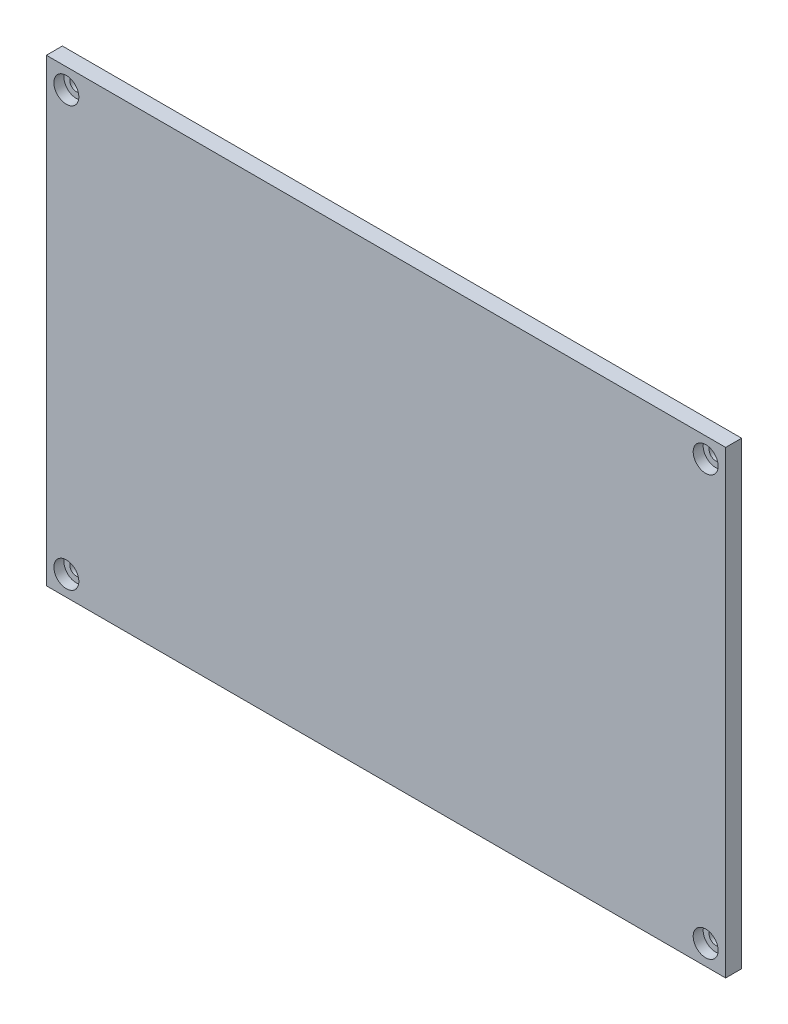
ISO-10303-21;
HEADER;
FILE_DESCRIPTION(('STEP AP214'),'2;1');
FILE_NAME('part.step','',(''),(''),'','','');
FILE_SCHEMA(('AUTOMOTIVE_DESIGN { 1 0 10303 214 1 1 1 1 }'));
ENDSEC;
DATA;
#1=APPLICATION_CONTEXT('core data for automotive mechanical design processes');
#2=APPLICATION_PROTOCOL_DEFINITION('international standard','automotive_design',2000,#1);
#3=PRODUCT_CONTEXT('',#1,'mechanical');
#4=PRODUCT('Part','Part','',(#3));
#5=PRODUCT_RELATED_PRODUCT_CATEGORY('part','',(#4));
#6=PRODUCT_DEFINITION_FORMATION('','',#4);
#7=PRODUCT_DEFINITION_CONTEXT('part definition',#1,'design');
#8=PRODUCT_DEFINITION('design','',#6,#7);
#9=PRODUCT_DEFINITION_SHAPE('','',#8);
#10=(LENGTH_UNIT() NAMED_UNIT(*) SI_UNIT(.MILLI.,.METRE.));
#11=(NAMED_UNIT(*) PLANE_ANGLE_UNIT() SI_UNIT($,.RADIAN.));
#12=(NAMED_UNIT(*) SI_UNIT($,.STERADIAN.) SOLID_ANGLE_UNIT());
#13=UNCERTAINTY_MEASURE_WITH_UNIT(LENGTH_MEASURE(1.E-05),#10,'distance_accuracy_value','');
#14=(GEOMETRIC_REPRESENTATION_CONTEXT(3) GLOBAL_UNCERTAINTY_ASSIGNED_CONTEXT((#13)) GLOBAL_UNIT_ASSIGNED_CONTEXT((#10,
#11,#12)) REPRESENTATION_CONTEXT('',''));
#15=CARTESIAN_POINT('',(0.,0.,0.));
#16=DIRECTION('',(0.,0.,1.));
#17=DIRECTION('',(1.,0.,0.));
#18=AXIS2_PLACEMENT_3D('',#15,#16,#17);
#19=CARTESIAN_POINT('',(0.,0.,0.));
#20=DIRECTION('',(0.,0.,1.));
#21=DIRECTION('',(1.,0.,0.));
#22=AXIS2_PLACEMENT_3D('',#19,#20,#21);
#23=PLANE('',#22);
#24=DIRECTION('',(-1.,0.,0.));
#25=VECTOR('',#24,1.);
#26=CARTESIAN_POINT('',(-1.88692341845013,42.7031703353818,0.));
#27=LINE('',#26,#25);
#28=CARTESIAN_POINT('',(-1.88692341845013,42.7031703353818,0.));
#29=VERTEX_POINT('',#28);
#30=CARTESIAN_POINT('',(-6.55000000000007,42.7031703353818,0.));
#31=VERTEX_POINT('',#30);
#32=EDGE_CURVE('E360',#29,#31,#27,.T.);
#33=ORIENTED_EDGE('',*,*,#32,.T.);
#34=DIRECTION('',(0.,-1.,0.));
#35=VECTOR('',#34,1.);
#36=CARTESIAN_POINT('',(-6.55000000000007,7.60317033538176,0.));
#37=LINE('',#36,#35);
#38=CARTESIAN_POINT('',(-6.55000000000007,7.60317033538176,0.));
#39=VERTEX_POINT('',#38);
#40=EDGE_CURVE('E534',#31,#39,#37,.T.);
#41=ORIENTED_EDGE('',*,*,#40,.T.);
#42=DIRECTION('',(-1.,0.,0.));
#43=VECTOR('',#42,1.);
#44=CARTESIAN_POINT('',(1.8,7.60317033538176,0.));
#45=LINE('',#44,#43);
#46=CARTESIAN_POINT('',(6.55000000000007,7.60317033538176,0.));
#47=VERTEX_POINT('',#46);
#48=EDGE_CURVE('E385',#47,#39,#45,.T.);
#49=ORIENTED_EDGE('',*,*,#48,.F.);
#50=DIRECTION('',(0.,1.,0.));
#51=VECTOR('',#50,1.);
#52=CARTESIAN_POINT('',(6.55000000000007,45.7031703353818,0.));
#53=LINE('',#52,#51);
#54=CARTESIAN_POINT('',(6.55000000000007,28.6597937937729,0.));
#55=VERTEX_POINT('',#54);
#56=EDGE_CURVE('E531',#47,#55,#53,.T.);
#57=ORIENTED_EDGE('',*,*,#56,.T.);
#58=CARTESIAN_POINT('',(11.5327574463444,29.074677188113,0.));
#59=DIRECTION('',(0.,0.,1.));
#60=DIRECTION('',(1.,0.,0.));
#61=AXIS2_PLACEMENT_3D('',#58,#59,#60);
#62=CIRCLE('',#61,4.99999999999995);
#63=CARTESIAN_POINT('',(6.55000000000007,29.4895605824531,0.));
#64=VERTEX_POINT('',#63);
#65=EDGE_CURVE('E513',#55,#64,#62,.T.);
#66=ORIENTED_EDGE('',*,*,#65,.T.);
#67=DIRECTION('',(0.,1.,0.));
#68=VECTOR('',#67,1.);
#69=CARTESIAN_POINT('',(6.55000000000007,45.7031703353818,0.));
#70=LINE('',#69,#68);
#71=CARTESIAN_POINT('',(6.55000000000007,45.7031703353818,0.));
#72=VERTEX_POINT('',#71);
#73=EDGE_CURVE('E528',#64,#72,#70,.T.);
#74=ORIENTED_EDGE('',*,*,#73,.T.);
#75=DIRECTION('',(1.,0.,0.));
#76=VECTOR('',#75,1.);
#77=CARTESIAN_POINT('',(1.8,45.7031703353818,0.));
#78=LINE('',#77,#76);
#79=CARTESIAN_POINT('',(-1.88692341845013,45.7031703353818,0.));
#80=VERTEX_POINT('',#79);
#81=EDGE_CURVE('E381',#80,#72,#78,.T.);
#82=ORIENTED_EDGE('',*,*,#81,.F.);
#83=DIRECTION('',(0.,-1.,0.));
#84=VECTOR('',#83,1.);
#85=CARTESIAN_POINT('',(-1.88692341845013,45.7031703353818,0.));
#86=LINE('',#85,#84);
#87=EDGE_CURVE('E357',#80,#29,#86,.T.);
#88=ORIENTED_EDGE('',*,*,#87,.T.);
#89=EDGE_LOOP('',(#33,#41,#49,#57,#66,#74,#82,#88));
#90=FACE_BOUND('',#89,.T.);
#91=CARTESIAN_POINT('',(62.4375719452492,36.757650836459,0.));
#92=DIRECTION('',(0.,0.,1.));
#93=DIRECTION('',(1.,0.,0.));
#94=AXIS2_PLACEMENT_3D('',#91,#92,#93);
#95=CIRCLE('',#94,4.99999999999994);
#96=CARTESIAN_POINT('',(67.4375719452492,36.757650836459,0.));
#97=VERTEX_POINT('',#96);
#98=EDGE_CURVE('E516',#97,#97,#95,.T.);
#99=ORIENTED_EDGE('',*,*,#98,.T.);
#100=EDGE_LOOP('',(#99));
#101=FACE_BOUND('',#100,.T.);
#102=CARTESIAN_POINT('',(11.5339011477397,2.0746772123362,0.));
#103=DIRECTION('',(0.,0.,1.));
#104=DIRECTION('',(1.,0.,0.));
#105=AXIS2_PLACEMENT_3D('',#102,#103,#104);
#106=CIRCLE('',#105,4.99999999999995);
#107=CARTESIAN_POINT('',(16.5339011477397,2.0746772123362,0.));
#108=VERTEX_POINT('',#107);
#109=EDGE_CURVE('E510',#108,#108,#106,.T.);
#110=ORIENTED_EDGE('',*,*,#109,.T.);
#111=EDGE_LOOP('',(#110));
#112=FACE_BOUND('',#111,.T.);
#113=CARTESIAN_POINT('',(-80.,-52.5,0.));
#114=DIRECTION('',(0.,0.,1.));
#115=DIRECTION('',(1.,0.,0.));
#116=AXIS2_PLACEMENT_3D('',#113,#114,#115);
#117=CIRCLE('',#116,1.65);
#118=CARTESIAN_POINT('',(-78.35,-52.5,0.));
#119=VERTEX_POINT('',#118);
#120=EDGE_CURVE('E438',#119,#119,#117,.F.);
#121=ORIENTED_EDGE('',*,*,#120,.F.);
#122=EDGE_LOOP('',(#121));
#123=FACE_BOUND('',#122,.T.);
#124=CARTESIAN_POINT('',(80.,-52.5,0.));
#125=DIRECTION('',(0.,0.,1.));
#126=DIRECTION('',(1.,0.,0.));
#127=AXIS2_PLACEMENT_3D('',#124,#125,#126);
#128=CIRCLE('',#127,1.65);
#129=CARTESIAN_POINT('',(81.65,-52.5,0.));
#130=VERTEX_POINT('',#129);
#131=EDGE_CURVE('E431',#130,#130,#128,.F.);
#132=ORIENTED_EDGE('',*,*,#131,.F.);
#133=EDGE_LOOP('',(#132));
#134=FACE_BOUND('',#133,.T.);
#135=CARTESIAN_POINT('',(80.,52.5,0.));
#136=DIRECTION('',(0.,0.,1.));
#137=DIRECTION('',(1.,0.,0.));
#138=AXIS2_PLACEMENT_3D('',#135,#136,#137);
#139=CIRCLE('',#138,1.65);
#140=CARTESIAN_POINT('',(81.65,52.5,0.));
#141=VERTEX_POINT('',#140);
#142=EDGE_CURVE('E430',#141,#141,#139,.F.);
#143=ORIENTED_EDGE('',*,*,#142,.F.);
#144=EDGE_LOOP('',(#143));
#145=FACE_BOUND('',#144,.T.);
#146=CARTESIAN_POINT('',(-80.,52.5,0.));
#147=DIRECTION('',(0.,0.,1.));
#148=DIRECTION('',(1.,0.,0.));
#149=AXIS2_PLACEMENT_3D('',#146,#147,#148);
#150=CIRCLE('',#149,1.65);
#151=CARTESIAN_POINT('',(-78.35,52.5,0.));
#152=VERTEX_POINT('',#151);
#153=EDGE_CURVE('E447',#152,#152,#150,.F.);
#154=ORIENTED_EDGE('',*,*,#153,.F.);
#155=EDGE_LOOP('',(#154));
#156=FACE_BOUND('',#155,.T.);
#157=DIRECTION('',(0.,-1.,0.));
#158=VECTOR('',#157,1.);
#159=CARTESIAN_POINT('',(-85.,-57.5,0.));
#160=LINE('',#159,#158);
#161=CARTESIAN_POINT('',(-85.,57.5,0.));
#162=VERTEX_POINT('',#161);
#163=CARTESIAN_POINT('',(-85.,-57.5,0.));
#164=VERTEX_POINT('',#163);
#165=EDGE_CURVE('E472',#162,#164,#160,.T.);
#166=ORIENTED_EDGE('',*,*,#165,.F.);
#167=DIRECTION('',(-1.,0.,0.));
#168=VECTOR('',#167,1.);
#169=CARTESIAN_POINT('',(85.,57.5,0.));
#170=LINE('',#169,#168);
#171=CARTESIAN_POINT('',(85.,57.5,0.));
#172=VERTEX_POINT('',#171);
#173=EDGE_CURVE('E479',#172,#162,#170,.T.);
#174=ORIENTED_EDGE('',*,*,#173,.F.);
#175=DIRECTION('',(0.,1.,0.));
#176=VECTOR('',#175,1.);
#177=CARTESIAN_POINT('',(85.,-57.5,0.));
#178=LINE('',#177,#176);
#179=CARTESIAN_POINT('',(85.,-57.5,0.));
#180=VERTEX_POINT('',#179);
#181=EDGE_CURVE('E490',#180,#172,#178,.T.);
#182=ORIENTED_EDGE('',*,*,#181,.F.);
#183=DIRECTION('',(1.,0.,0.));
#184=VECTOR('',#183,1.);
#185=CARTESIAN_POINT('',(85.,-57.5,0.));
#186=LINE('',#185,#184);
#187=EDGE_CURVE('E488',#164,#180,#186,.T.);
#188=ORIENTED_EDGE('',*,*,#187,.F.);
#189=EDGE_LOOP('',(#166,#174,#182,#188));
#190=FACE_BOUND('',#189,.T.);
#191=CARTESIAN_POINT('',(62.4375719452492,-4.29999999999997,0.));
#192=DIRECTION('',(0.,0.,1.));
#193=DIRECTION('',(1.,0.,0.));
#194=AXIS2_PLACEMENT_3D('',#191,#192,#193);
#195=CIRCLE('',#194,4.99999999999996);
#196=CARTESIAN_POINT('',(66.1600580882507,-7.63812775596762,0.));
#197=VERTEX_POINT('',#196);
#198=CARTESIAN_POINT('',(58.7150858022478,-7.63812775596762,0.));
#199=VERTEX_POINT('',#198);
#200=EDGE_CURVE('E507',#197,#199,#195,.T.);
#201=ORIENTED_EDGE('',*,*,#200,.T.);
#202=DIRECTION('',(1.,0.,0.));
#203=VECTOR('',#202,1.);
#204=CARTESIAN_POINT('',(68.7792344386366,-7.63812775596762,0.));
#205=LINE('',#204,#203);
#206=EDGE_CURVE('E318',#199,#197,#205,.T.);
#207=ORIENTED_EDGE('',*,*,#206,.T.);
#208=EDGE_LOOP('',(#201,#207));
#209=FACE_BOUND('',#208,.T.);
#210=DIRECTION('',(0.,-1.,0.));
#211=VECTOR('',#210,1.);
#212=CARTESIAN_POINT('',(-47.74953873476,28.5,0.));
#213=LINE('',#212,#211);
#214=CARTESIAN_POINT('',(-47.74953873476,28.5,0.));
#215=VERTEX_POINT('',#214);
#216=CARTESIAN_POINT('',(-47.74953873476,8.50000000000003,0.));
#217=VERTEX_POINT('',#216);
#218=EDGE_CURVE('E340',#215,#217,#213,.T.);
#219=ORIENTED_EDGE('',*,*,#218,.F.);
#220=DIRECTION('',(1.,0.,0.));
#221=VECTOR('',#220,1.);
#222=CARTESIAN_POINT('',(-47.74953873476,28.5,0.));
#223=LINE('',#222,#221);
#224=CARTESIAN_POINT('',(-55.74953873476,28.5,0.));
#225=VERTEX_POINT('',#224);
#226=EDGE_CURVE('E288',#225,#215,#223,.T.);
#227=ORIENTED_EDGE('',*,*,#226,.F.);
#228=DIRECTION('',(0.,1.,0.));
#229=VECTOR('',#228,1.);
#230=CARTESIAN_POINT('',(-55.74953873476,28.5,0.));
#231=LINE('',#230,#229);
#232=CARTESIAN_POINT('',(-55.74953873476,8.50000000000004,0.));
#233=VERTEX_POINT('',#232);
#234=EDGE_CURVE('E329',#233,#225,#231,.T.);
#235=ORIENTED_EDGE('',*,*,#234,.F.);
#236=DIRECTION('',(-1.,0.,0.));
#237=VECTOR('',#236,1.);
#238=CARTESIAN_POINT('',(-47.74953873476,8.50000000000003,0.));
#239=LINE('',#238,#237);
#240=EDGE_CURVE('E343',#217,#233,#239,.T.);
#241=ORIENTED_EDGE('',*,*,#240,.F.);
#242=EDGE_LOOP('',(#219,#227,#235,#241));
#243=FACE_BOUND('',#242,.T.);
#244=DIRECTION('',(1.,0.,0.));
#245=VECTOR('',#244,1.);
#246=CARTESIAN_POINT('',(-17.2504612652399,28.5,0.));
#247=LINE('',#246,#245);
#248=CARTESIAN_POINT('',(-17.2504612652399,28.5,0.));
#249=VERTEX_POINT('',#248);
#250=CARTESIAN_POINT('',(-9.25046126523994,28.5,0.));
#251=VERTEX_POINT('',#250);
#252=EDGE_CURVE('E307',#249,#251,#247,.T.);
#253=ORIENTED_EDGE('',*,*,#252,.F.);
#254=DIRECTION('',(0.,1.,0.));
#255=VECTOR('',#254,1.);
#256=CARTESIAN_POINT('',(-17.2504612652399,28.5,0.));
#257=LINE('',#256,#255);
#258=CARTESIAN_POINT('',(-17.2504612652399,8.50000000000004,0.));
#259=VERTEX_POINT('',#258);
#260=EDGE_CURVE('E305',#259,#249,#257,.T.);
#261=ORIENTED_EDGE('',*,*,#260,.F.);
#262=DIRECTION('',(-1.,0.,0.));
#263=VECTOR('',#262,1.);
#264=CARTESIAN_POINT('',(-17.2504612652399,8.50000000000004,0.));
#265=LINE('',#264,#263);
#266=CARTESIAN_POINT('',(-9.25046126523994,8.50000000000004,0.));
#267=VERTEX_POINT('',#266);
#268=EDGE_CURVE('E295',#267,#259,#265,.T.);
#269=ORIENTED_EDGE('',*,*,#268,.F.);
#270=DIRECTION('',(0.,-1.,0.));
#271=VECTOR('',#270,1.);
#272=CARTESIAN_POINT('',(-9.25046126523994,28.5,0.));
#273=LINE('',#272,#271);
#274=EDGE_CURVE('E311',#251,#267,#273,.T.);
#275=ORIENTED_EDGE('',*,*,#274,.F.);
#276=EDGE_LOOP('',(#253,#261,#269,#275));
#277=FACE_BOUND('',#276,.T.);
#278=DIRECTION('',(0.,-1.,0.));
#279=VECTOR('',#278,1.);
#280=CARTESIAN_POINT('',(-15.,51.,0.));
#281=LINE('',#280,#279);
#282=CARTESIAN_POINT('',(-15.,55.,0.));
#283=VERTEX_POINT('',#282);
#284=CARTESIAN_POINT('',(-15.,51.,0.));
#285=VERTEX_POINT('',#284);
#286=EDGE_CURVE('E267',#283,#285,#281,.T.);
#287=ORIENTED_EDGE('',*,*,#286,.F.);
#288=DIRECTION('',(1.,0.,0.));
#289=VECTOR('',#288,1.);
#290=CARTESIAN_POINT('',(-52.704163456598,55.,0.));
#291=LINE('',#290,#289);
#292=CARTESIAN_POINT('',(-50.,55.,0.));
#293=VERTEX_POINT('',#292);
#294=EDGE_CURVE('E264',#293,#283,#291,.T.);
#295=ORIENTED_EDGE('',*,*,#294,.F.);
#296=DIRECTION('',(0.,1.,0.));
#297=VECTOR('',#296,1.);
#298=CARTESIAN_POINT('',(-50.,51.,0.));
#299=LINE('',#298,#297);
#300=CARTESIAN_POINT('',(-50.,51.,0.));
#301=VERTEX_POINT('',#300);
#302=EDGE_CURVE('E275',#301,#293,#299,.T.);
#303=ORIENTED_EDGE('',*,*,#302,.F.);
#304=DIRECTION('',(-1.,0.,0.));
#305=VECTOR('',#304,1.);
#306=CARTESIAN_POINT('',(-15.,51.,0.));
#307=LINE('',#306,#305);
#308=EDGE_CURVE('E282',#285,#301,#307,.T.);
#309=ORIENTED_EDGE('',*,*,#308,.F.);
#310=EDGE_LOOP('',(#287,#295,#303,#309));
#311=FACE_BOUND('',#310,.T.);
#312=ADVANCED_FACE('F44',(#90,#101,#112,#123,#134,#145,#156,#190,#209,#243,#277,#311),#23,.F.);
#313=CARTESIAN_POINT('',(62.4375719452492,-4.29999999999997,-1.99999999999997));
#314=DIRECTION('',(0.,0.,1.));
#315=DIRECTION('',(1.,0.,0.));
#316=AXIS2_PLACEMENT_3D('',#313,#314,#315);
#317=CONICAL_SURFACE('',#316,3.,0.785398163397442);
#318=CARTESIAN_POINT('',(62.4375719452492,-4.29999999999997,-1.99999999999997));
#319=DIRECTION('',(0.,0.,1.));
#320=DIRECTION('',(1.,0.,0.));
#321=AXIS2_PLACEMENT_3D('',#318,#319,#320);
#322=CIRCLE('',#321,3.);
#323=CARTESIAN_POINT('',(65.4375719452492,-4.29999999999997,-1.99999999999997));
#324=VERTEX_POINT('',#323);
#325=EDGE_CURVE('E525',#324,#324,#322,.F.);
#326=ORIENTED_EDGE('',*,*,#325,.F.);
#327=EDGE_LOOP('',(#326));
#328=FACE_BOUND('',#327,.T.);
#329=CARTESIAN_POINT('',(47.6104558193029,-7.63812775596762,10.1982390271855));
#330=CARTESIAN_POINT('',(48.0257057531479,-7.63812775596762,9.79316463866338));
#331=CARTESIAN_POINT('',(48.4413329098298,-7.63812775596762,9.38847535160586));
#332=CARTESIAN_POINT('',(49.2736796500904,-7.63812775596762,8.58016997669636));
#333=CARTESIAN_POINT('',(49.6903993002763,-7.63812775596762,8.17655395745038));
#334=CARTESIAN_POINT('',(50.5262342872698,-7.63812775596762,7.36976707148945));
#335=CARTESIAN_POINT('',(50.9453529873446,-7.63812775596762,6.96659968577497));
#336=CARTESIAN_POINT('',(51.7854557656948,-7.63812775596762,6.16225602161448));
#337=CARTESIAN_POINT('',(52.2064397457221,-7.63812775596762,5.76107964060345));
#338=CARTESIAN_POINT('',(53.0679788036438,-7.63812775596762,4.94545984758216));
#339=CARTESIAN_POINT('',(53.5086415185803,-7.63812775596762,4.53112981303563));
#340=CARTESIAN_POINT('',(54.1728629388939,-7.63812775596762,3.91302582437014));
#341=CARTESIAN_POINT('',(54.3948270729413,-7.63812775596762,3.70753892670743));
#342=CARTESIAN_POINT('',(54.8400916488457,-7.63812775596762,3.29801989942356));
#343=CARTESIAN_POINT('',(55.0633920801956,-7.63812775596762,3.09398775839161));
#344=CARTESIAN_POINT('',(55.5114123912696,-7.63812775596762,2.68803033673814));
#345=CARTESIAN_POINT('',(55.7361302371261,-7.63812775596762,2.48610281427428));
#346=CARTESIAN_POINT('',(56.1877354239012,-7.63812775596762,2.08468973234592));
#347=CARTESIAN_POINT('',(56.4146227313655,-7.63812775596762,1.88520413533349));
#348=CARTESIAN_POINT('',(56.871196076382,-7.63812775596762,1.48957973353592));
#349=CARTESIAN_POINT('',(57.1008813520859,-7.63812775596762,1.29344005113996));
#350=CARTESIAN_POINT('',(57.5640824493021,-7.63812775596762,0.905747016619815));
#351=CARTESIAN_POINT('',(57.7975979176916,-7.63812775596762,0.714193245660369));
#352=CARTESIAN_POINT('',(58.1189722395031,-7.63812775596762,0.458093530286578));
#353=CARTESIAN_POINT('',(58.2045133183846,-7.63812775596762,0.39063823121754));
#354=CARTESIAN_POINT('',(58.3763905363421,-7.63812775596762,0.256746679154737));
#355=CARTESIAN_POINT('',(58.462726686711,-7.63812775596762,0.190310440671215));
#356=CARTESIAN_POINT('',(58.7231208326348,-7.63812775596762,-0.00726496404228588));
#357=CARTESIAN_POINT('',(58.8985286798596,-7.63812775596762,-0.136642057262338));
#358=CARTESIAN_POINT('',(59.253734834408,-7.63812775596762,-0.38868073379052));
#359=CARTESIAN_POINT('',(59.4335262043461,-7.63812775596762,-0.511352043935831));
#360=CARTESIAN_POINT('',(59.7991381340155,-7.63812775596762,-0.747368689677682));
#361=CARTESIAN_POINT('',(59.9849562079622,-7.63812775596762,-0.860717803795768));
#362=CARTESIAN_POINT('',(60.2846406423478,-7.63812775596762,-1.02885629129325));
#363=CARTESIAN_POINT('',(60.395923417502,-7.63812775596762,-1.0882350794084));
#364=CARTESIAN_POINT('',(60.6215007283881,-7.63812775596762,-1.20109768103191));
#365=CARTESIAN_POINT('',(60.7357959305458,-7.63812775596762,-1.25458017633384));
#366=CARTESIAN_POINT('',(60.9673996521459,-7.63812775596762,-1.35396234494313));
#367=CARTESIAN_POINT('',(61.0847016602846,-7.63812775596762,-1.39987702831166));
#368=CARTESIAN_POINT('',(61.3225185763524,-7.63812775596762,-1.48232592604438));
#369=CARTESIAN_POINT('',(61.4430309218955,-7.63812775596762,-1.51886738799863));
#370=CARTESIAN_POINT('',(61.6610070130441,-7.63812775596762,-1.57399331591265));
#371=CARTESIAN_POINT('',(61.7579203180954,-7.63812775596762,-1.59474411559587));
#372=CARTESIAN_POINT('',(61.953124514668,-7.63812775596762,-1.62827172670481));
#373=CARTESIAN_POINT('',(62.0514151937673,-7.63812775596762,-1.64104975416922));
#374=CARTESIAN_POINT('',(62.2485482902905,-7.63812775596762,-1.65796374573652));
#375=CARTESIAN_POINT('',(62.3473891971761,-7.63812775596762,-1.6621170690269));
#376=CARTESIAN_POINT('',(62.5450509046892,-7.63812775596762,-1.66160501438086));
#377=CARTESIAN_POINT('',(62.6438717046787,-7.63812775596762,-1.65693939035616));
#378=CARTESIAN_POINT('',(62.8403938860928,-7.63812775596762,-1.63907546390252));
#379=CARTESIAN_POINT('',(62.9380979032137,-7.63812775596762,-1.62590569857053));
#380=CARTESIAN_POINT('',(63.1321282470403,-7.63812775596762,-1.59171940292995));
#381=CARTESIAN_POINT('',(63.2284542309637,-7.63812775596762,-1.57070095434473));
#382=CARTESIAN_POINT('',(63.4195716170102,-7.63812775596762,-1.5216584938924));
#383=CARTESIAN_POINT('',(63.5143579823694,-7.63812775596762,-1.49361508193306));
#384=CARTESIAN_POINT('',(63.701924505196,-7.63812775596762,-1.43154798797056));
#385=CARTESIAN_POINT('',(63.794704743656,-7.63812775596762,-1.39752454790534));
#386=CARTESIAN_POINT('',(64.0156240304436,-7.63812775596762,-1.30956695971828));
#387=CARTESIAN_POINT('',(64.1427779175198,-7.63812775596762,-1.25316650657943));
#388=CARTESIAN_POINT('',(64.3934074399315,-7.63812775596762,-1.13266168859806));
#389=CARTESIAN_POINT('',(64.516880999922,-7.63812775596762,-1.06855307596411));
#390=CARTESIAN_POINT('',(64.7608041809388,-7.63812775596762,-0.934275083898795));
#391=CARTESIAN_POINT('',(64.8812468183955,-7.63812775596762,-0.864093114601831));
#392=CARTESIAN_POINT('',(65.1192866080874,-7.63812775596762,-0.719137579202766));
#393=CARTESIAN_POINT('',(65.2368842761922,-7.63812775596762,-0.644364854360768));
#394=CARTESIAN_POINT('',(65.4714211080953,-7.63812775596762,-0.490074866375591));
#395=CARTESIAN_POINT('',(65.5883246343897,-7.63812775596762,-0.410503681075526));
#396=CARTESIAN_POINT('',(65.8200705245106,-7.63812775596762,-0.2484171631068));
#397=CARTESIAN_POINT('',(65.9349128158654,-7.63812775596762,-0.165901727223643));
#398=CARTESIAN_POINT('',(66.1627107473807,-7.63812775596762,0.00137834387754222));
#399=CARTESIAN_POINT('',(66.2756686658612,-7.63812775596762,0.0861398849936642));
#400=CARTESIAN_POINT('',(66.5001131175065,-7.63812775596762,0.257576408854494));
#401=CARTESIAN_POINT('',(66.6115997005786,-7.63812775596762,0.344251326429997));
#402=CARTESIAN_POINT('',(66.9711662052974,-7.63812775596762,0.627883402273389));
#403=CARTESIAN_POINT('',(67.2167607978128,-7.63812775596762,0.827990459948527));
#404=CARTESIAN_POINT('',(67.7035866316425,-7.63812775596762,1.23345645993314));
#405=CARTESIAN_POINT('',(67.9448173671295,-7.63812775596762,1.43881600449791));
#406=CARTESIAN_POINT('',(68.4241518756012,-7.63812775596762,1.85330229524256));
#407=CARTESIAN_POINT('',(68.6622545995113,-7.63812775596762,2.06243025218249));
#408=CARTESIAN_POINT('',(69.1360622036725,-7.63812775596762,2.48338652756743));
#409=CARTESIAN_POINT('',(69.3717670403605,-7.63812775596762,2.69521489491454));
#410=CARTESIAN_POINT('',(69.8417487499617,-7.63812775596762,3.12127322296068));
#411=CARTESIAN_POINT('',(70.0760223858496,-7.63812775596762,3.33550674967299));
#412=CARTESIAN_POINT('',(70.5431244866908,-7.63812775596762,3.76554636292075));
#413=CARTESIAN_POINT('',(70.7759529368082,-7.63812775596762,3.98135246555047));
#414=CARTESIAN_POINT('',(71.4726323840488,-7.63812775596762,4.63051315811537));
#415=CARTESIAN_POINT('',(71.9347756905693,-7.63812775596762,5.06569973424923));
#416=CARTESIAN_POINT('',(72.8050857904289,-7.63812775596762,5.89090012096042));
#417=CARTESIAN_POINT('',(73.2135665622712,-7.63812775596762,6.28058379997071));
#418=CARTESIAN_POINT('',(74.0288218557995,-7.63812775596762,7.06178144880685));
#419=CARTESIAN_POINT('',(74.4355962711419,-7.63812775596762,7.45329552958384));
#420=CARTESIAN_POINT('',(75.246658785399,-7.63812775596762,8.23649139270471));
#421=CARTESIAN_POINT('',(75.6509506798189,-7.63812775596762,8.6281692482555));
#422=CARTESIAN_POINT('',(76.458510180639,-7.63812775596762,9.41252276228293));
#423=CARTESIAN_POINT('',(76.8617778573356,-7.63812775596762,9.80519834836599));
#424=CARTESIAN_POINT('',(77.2646880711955,-7.63812775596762,10.1982390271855));
#425=B_SPLINE_CURVE_WITH_KNOTS('',3,(#329,#330,#331,#332,#333,#334,#335,#336,#337,#338,#339,
#340,#341,#342,#343,#344,#345,#346,#347,#348,#349,#350,#351,#352,#353,#354,#355,#356,#357,#358,
#359,#360,#361,#362,#363,#364,#365,#366,#367,#368,#369,#370,#371,#372,#373,#374,#375,#376,#377,
#378,#379,#380,#381,#382,#383,#384,#385,#386,#387,#388,#389,#390,#391,#392,#393,#394,#395,#396,
#397,#398,#399,#400,#401,#402,#403,#404,#405,#406,#407,#408,#409,#410,#411,#412,#413,#414,#415,
#416,#417,#418,#419,#420,#421,#422,#423,#424),.UNSPECIFIED.,.F.,.F.,(4,2,2,2,2,2,2,2,2,2,2,2,2,
2,2,2,2,2,2,2,2,2,2,2,2,2,2,2,2,2,2,2,2,2,2,2,2,2,2,2,2,2,2,2,2,2,2,4),(0.,1.74030593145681,
3.48072055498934,5.22537592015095,6.96994045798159,8.78448876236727,9.69191799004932,
10.5993400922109,11.5056691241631,12.4119842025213,13.3180577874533,14.2240483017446,
14.5508555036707,14.8776673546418,15.5314288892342,16.1842154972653,16.8367361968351,
17.215004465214,17.5933571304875,17.9709500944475,18.3482502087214,18.6452886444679,
18.9422817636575,19.2386765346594,19.5350795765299,19.8304931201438,20.1259789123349,
20.4222898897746,20.7185888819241,21.1355349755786,21.5527119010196,21.9707753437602,
22.3887624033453,22.8129490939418,23.2371506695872,23.6607955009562,24.0844259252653,
25.0346850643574,25.9850536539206,26.9357332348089,27.8864300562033,28.8387974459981,
29.7911745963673,31.6955300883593,33.389156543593,35.0828870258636,36.7716039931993,
38.4602017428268),.UNSPECIFIED.);
#426=EDGE_CURVE('E11',#199,#197,#425,.T.);
#427=ORIENTED_EDGE('',*,*,#426,.F.);
#428=ORIENTED_EDGE('',*,*,#200,.F.);
#429=EDGE_LOOP('',(#427,#428));
#430=FACE_BOUND('',#429,.T.);
#431=ADVANCED_FACE('F565',(#328,#430),#317,.T.);
#432=CARTESIAN_POINT('',(-85.,-57.5,4.));
#433=DIRECTION('',(1.,0.,0.));
#434=DIRECTION('',(0.,0.,-1.));
#435=AXIS2_PLACEMENT_3D('',#432,#433,#434);
#436=PLANE('',#435);
#437=ORIENTED_EDGE('',*,*,#165,.T.);
#438=DIRECTION('',(0.,0.,-1.));
#439=VECTOR('',#438,1.);
#440=CARTESIAN_POINT('',(-85.,-57.5,4.));
#441=LINE('',#440,#439);
#442=CARTESIAN_POINT('',(-85.,-57.5,4.));
#443=VERTEX_POINT('',#442);
#444=EDGE_CURVE('E501',#443,#164,#441,.T.);
#445=ORIENTED_EDGE('',*,*,#444,.F.);
#446=DIRECTION('',(0.,-1.,0.));
#447=VECTOR('',#446,1.);
#448=CARTESIAN_POINT('',(-85.,-57.5,4.));
#449=LINE('',#448,#447);
#450=CARTESIAN_POINT('',(-85.,57.5,4.));
#451=VERTEX_POINT('',#450);
#452=EDGE_CURVE('E475',#451,#443,#449,.T.);
#453=ORIENTED_EDGE('',*,*,#452,.F.);
#454=DIRECTION('',(0.,0.,-1.));
#455=VECTOR('',#454,1.);
#456=CARTESIAN_POINT('',(-85.,57.5,4.));
#457=LINE('',#456,#455);
#458=EDGE_CURVE('E485',#451,#162,#457,.T.);
#459=ORIENTED_EDGE('',*,*,#458,.T.);
#460=EDGE_LOOP('',(#437,#445,#453,#459));
#461=FACE_BOUND('',#460,.T.);
#462=ADVANCED_FACE('F571',(#461),#436,.F.);
#463=CARTESIAN_POINT('',(85.,-57.5,4.));
#464=DIRECTION('',(0.,1.,0.));
#465=DIRECTION('',(-1.,0.,0.));
#466=AXIS2_PLACEMENT_3D('',#463,#464,#465);
#467=PLANE('',#466);
#468=ORIENTED_EDGE('',*,*,#187,.T.);
#469=DIRECTION('',(0.,0.,-1.));
#470=VECTOR('',#469,1.);
#471=CARTESIAN_POINT('',(85.,-57.5,4.));
#472=LINE('',#471,#470);
#473=CARTESIAN_POINT('',(85.,-57.5,4.));
#474=VERTEX_POINT('',#473);
#475=EDGE_CURVE('E498',#474,#180,#472,.T.);
#476=ORIENTED_EDGE('',*,*,#475,.F.);
#477=DIRECTION('',(1.,0.,0.));
#478=VECTOR('',#477,1.);
#479=CARTESIAN_POINT('',(85.,-57.5,4.));
#480=LINE('',#479,#478);
#481=EDGE_CURVE('E478',#443,#474,#480,.T.);
#482=ORIENTED_EDGE('',*,*,#481,.F.);
#483=ORIENTED_EDGE('',*,*,#444,.T.);
#484=EDGE_LOOP('',(#468,#476,#482,#483));
#485=FACE_BOUND('',#484,.T.);
#486=ADVANCED_FACE('F733',(#485),#467,.F.);
#487=CARTESIAN_POINT('',(85.,-57.5,4.));
#488=DIRECTION('',(-1.,0.,0.));
#489=DIRECTION('',(0.,0.,1.));
#490=AXIS2_PLACEMENT_3D('',#487,#488,#489);
#491=PLANE('',#490);
#492=ORIENTED_EDGE('',*,*,#181,.T.);
#493=DIRECTION('',(0.,0.,-1.));
#494=VECTOR('',#493,1.);
#495=CARTESIAN_POINT('',(85.,57.5,4.));
#496=LINE('',#495,#494);
#497=CARTESIAN_POINT('',(85.,57.5,4.));
#498=VERTEX_POINT('',#497);
#499=EDGE_CURVE('E495',#498,#172,#496,.T.);
#500=ORIENTED_EDGE('',*,*,#499,.F.);
#501=DIRECTION('',(0.,1.,0.));
#502=VECTOR('',#501,1.);
#503=CARTESIAN_POINT('',(85.,-57.5,4.));
#504=LINE('',#503,#502);
#505=EDGE_CURVE('E481',#474,#498,#504,.T.);
#506=ORIENTED_EDGE('',*,*,#505,.F.);
#507=ORIENTED_EDGE('',*,*,#475,.T.);
#508=EDGE_LOOP('',(#492,#500,#506,#507));
#509=FACE_BOUND('',#508,.T.);
#510=ADVANCED_FACE('F715',(#509),#491,.F.);
#511=CARTESIAN_POINT('',(85.,57.5,4.));
#512=DIRECTION('',(0.,-1.,0.));
#513=DIRECTION('',(1.,0.,0.));
#514=AXIS2_PLACEMENT_3D('',#511,#512,#513);
#515=PLANE('',#514);
#516=ORIENTED_EDGE('',*,*,#173,.T.);
#517=ORIENTED_EDGE('',*,*,#458,.F.);
#518=DIRECTION('',(-1.,0.,0.));
#519=VECTOR('',#518,1.);
#520=CARTESIAN_POINT('',(85.,57.5,4.));
#521=LINE('',#520,#519);
#522=EDGE_CURVE('E483',#498,#451,#521,.T.);
#523=ORIENTED_EDGE('',*,*,#522,.F.);
#524=ORIENTED_EDGE('',*,*,#499,.T.);
#525=EDGE_LOOP('',(#516,#517,#523,#524));
#526=FACE_BOUND('',#525,.T.);
#527=ADVANCED_FACE('F710',(#526),#515,.F.);
#528=CARTESIAN_POINT('',(0.,0.,4.));
#529=DIRECTION('',(0.,0.,1.));
#530=DIRECTION('',(1.,0.,0.));
#531=AXIS2_PLACEMENT_3D('',#528,#529,#530);
#532=PLANE('',#531);
#533=CARTESIAN_POINT('',(80.,-52.5,4.));
#534=DIRECTION('',(0.,0.,1.));
#535=DIRECTION('',(1.,0.,0.));
#536=AXIS2_PLACEMENT_3D('',#533,#534,#535);
#537=CIRCLE('',#536,3.125);
#538=CARTESIAN_POINT('',(83.125,-52.5,4.));
#539=VERTEX_POINT('',#538);
#540=EDGE_CURVE('E450',#539,#539,#537,.T.);
#541=ORIENTED_EDGE('',*,*,#540,.F.);
#542=EDGE_LOOP('',(#541));
#543=FACE_BOUND('',#542,.T.);
#544=CARTESIAN_POINT('',(80.,52.5,4.));
#545=DIRECTION('',(0.,0.,1.));
#546=DIRECTION('',(1.,0.,0.));
#547=AXIS2_PLACEMENT_3D('',#544,#545,#546);
#548=CIRCLE('',#547,3.125);
#549=CARTESIAN_POINT('',(83.125,52.5,4.));
#550=VERTEX_POINT('',#549);
#551=EDGE_CURVE('E461',#550,#550,#548,.T.);
#552=ORIENTED_EDGE('',*,*,#551,.F.);
#553=EDGE_LOOP('',(#552));
#554=FACE_BOUND('',#553,.T.);
#555=CARTESIAN_POINT('',(-80.,52.5,4.));
#556=DIRECTION('',(0.,0.,1.));
#557=DIRECTION('',(1.,0.,0.));
#558=AXIS2_PLACEMENT_3D('',#555,#556,#557);
#559=CIRCLE('',#558,3.125);
#560=CARTESIAN_POINT('',(-76.875,52.5,4.));
#561=VERTEX_POINT('',#560);
#562=EDGE_CURVE('E455',#561,#561,#559,.T.);
#563=ORIENTED_EDGE('',*,*,#562,.F.);
#564=EDGE_LOOP('',(#563));
#565=FACE_BOUND('',#564,.T.);
#566=CARTESIAN_POINT('',(-80.,-52.5,4.));
#567=DIRECTION('',(0.,0.,1.));
#568=DIRECTION('',(1.,0.,0.));
#569=AXIS2_PLACEMENT_3D('',#566,#567,#568);
#570=CIRCLE('',#569,3.125);
#571=CARTESIAN_POINT('',(-76.875,-52.5,4.));
#572=VERTEX_POINT('',#571);
#573=EDGE_CURVE('E454',#572,#572,#570,.T.);
#574=ORIENTED_EDGE('',*,*,#573,.F.);
#575=EDGE_LOOP('',(#574));
#576=FACE_BOUND('',#575,.T.);
#577=ORIENTED_EDGE('',*,*,#452,.T.);
#578=ORIENTED_EDGE('',*,*,#481,.T.);
#579=ORIENTED_EDGE('',*,*,#505,.T.);
#580=ORIENTED_EDGE('',*,*,#522,.T.);
#581=EDGE_LOOP('',(#577,#578,#579,#580));
#582=FACE_BOUND('',#581,.T.);
#583=ADVANCED_FACE('F707',(#543,#554,#565,#576,#582),#532,.T.);
#584=CARTESIAN_POINT('',(-80.,-52.5,1.5));
#585=DIRECTION('',(0.,0.,1.));
#586=DIRECTION('',(1.,0.,0.));
#587=AXIS2_PLACEMENT_3D('',#584,#585,#586);
#588=CYLINDRICAL_SURFACE('',#587,3.125);
#589=CARTESIAN_POINT('',(-80.,-52.5,1.5));
#590=DIRECTION('',(0.,0.,1.));
#591=DIRECTION('',(1.,0.,0.));
#592=AXIS2_PLACEMENT_3D('',#589,#590,#591);
#593=CIRCLE('',#592,3.125);
#594=CARTESIAN_POINT('',(-76.875,-52.5,1.5));
#595=VERTEX_POINT('',#594);
#596=EDGE_CURVE('E469',#595,#595,#593,.T.);
#597=ORIENTED_EDGE('',*,*,#596,.F.);
#598=EDGE_LOOP('',(#597));
#599=FACE_BOUND('',#598,.T.);
#600=ORIENTED_EDGE('',*,*,#573,.T.);
#601=EDGE_LOOP('',(#600));
#602=FACE_BOUND('',#601,.T.);
#603=ADVANCED_FACE('F704',(#599,#602),#588,.F.);
#604=CARTESIAN_POINT('',(-80.,-52.5,1.5));
#605=DIRECTION('',(0.,0.,1.));
#606=DIRECTION('',(1.,0.,0.));
#607=AXIS2_PLACEMENT_3D('',#604,#605,#606);
#608=PLANE('',#607);
#609=CARTESIAN_POINT('',(-80.,-52.5,1.5));
#610=DIRECTION('',(0.,0.,1.));
#611=DIRECTION('',(1.,0.,0.));
#612=AXIS2_PLACEMENT_3D('',#609,#610,#611);
#613=CIRCLE('',#612,1.65);
#614=CARTESIAN_POINT('',(-78.35,-52.5,1.5));
#615=VERTEX_POINT('',#614);
#616=EDGE_CURVE('E426',#615,#615,#613,.T.);
#617=ORIENTED_EDGE('',*,*,#616,.F.);
#618=EDGE_LOOP('',(#617));
#619=FACE_BOUND('',#618,.T.);
#620=ORIENTED_EDGE('',*,*,#596,.T.);
#621=EDGE_LOOP('',(#620));
#622=FACE_BOUND('',#621,.T.);
#623=ADVANCED_FACE('F686',(#619,#622),#608,.T.);
#624=CARTESIAN_POINT('',(-80.,52.5,1.5));
#625=DIRECTION('',(0.,0.,1.));
#626=DIRECTION('',(1.,0.,0.));
#627=AXIS2_PLACEMENT_3D('',#624,#625,#626);
#628=CYLINDRICAL_SURFACE('',#627,3.125);
#629=CARTESIAN_POINT('',(-80.,52.5,1.5));
#630=DIRECTION('',(0.,0.,1.));
#631=DIRECTION('',(1.,0.,0.));
#632=AXIS2_PLACEMENT_3D('',#629,#630,#631);
#633=CIRCLE('',#632,3.125);
#634=CARTESIAN_POINT('',(-76.875,52.5,1.5));
#635=VERTEX_POINT('',#634);
#636=EDGE_CURVE('E451',#635,#635,#633,.T.);
#637=ORIENTED_EDGE('',*,*,#636,.F.);
#638=EDGE_LOOP('',(#637));
#639=FACE_BOUND('',#638,.T.);
#640=ORIENTED_EDGE('',*,*,#562,.T.);
#641=EDGE_LOOP('',(#640));
#642=FACE_BOUND('',#641,.T.);
#643=ADVANCED_FACE('F682',(#639,#642),#628,.F.);
#644=CARTESIAN_POINT('',(-80.,52.5,1.5));
#645=DIRECTION('',(0.,0.,1.));
#646=DIRECTION('',(1.,0.,0.));
#647=AXIS2_PLACEMENT_3D('',#644,#645,#646);
#648=PLANE('',#647);
#649=CARTESIAN_POINT('',(-80.,52.5,1.5));
#650=DIRECTION('',(0.,0.,1.));
#651=DIRECTION('',(1.,0.,0.));
#652=AXIS2_PLACEMENT_3D('',#649,#650,#651);
#653=CIRCLE('',#652,1.65);
#654=CARTESIAN_POINT('',(-78.35,52.5,1.5));
#655=VERTEX_POINT('',#654);
#656=EDGE_CURVE('E434',#655,#655,#653,.T.);
#657=ORIENTED_EDGE('',*,*,#656,.F.);
#658=EDGE_LOOP('',(#657));
#659=FACE_BOUND('',#658,.T.);
#660=ORIENTED_EDGE('',*,*,#636,.T.);
#661=EDGE_LOOP('',(#660));
#662=FACE_BOUND('',#661,.T.);
#663=ADVANCED_FACE('F678',(#659,#662),#648,.T.);
#664=CARTESIAN_POINT('',(80.,52.5,1.5));
#665=DIRECTION('',(0.,0.,1.));
#666=DIRECTION('',(1.,0.,0.));
#667=AXIS2_PLACEMENT_3D('',#664,#665,#666);
#668=CYLINDRICAL_SURFACE('',#667,3.125);
#669=CARTESIAN_POINT('',(80.,52.5,1.5));
#670=DIRECTION('',(0.,0.,1.));
#671=DIRECTION('',(1.,0.,0.));
#672=AXIS2_PLACEMENT_3D('',#669,#670,#671);
#673=CIRCLE('',#672,3.125);
#674=CARTESIAN_POINT('',(83.125,52.5,1.5));
#675=VERTEX_POINT('',#674);
#676=EDGE_CURVE('E458',#675,#675,#673,.T.);
#677=ORIENTED_EDGE('',*,*,#676,.F.);
#678=EDGE_LOOP('',(#677));
#679=FACE_BOUND('',#678,.T.);
#680=ORIENTED_EDGE('',*,*,#551,.T.);
#681=EDGE_LOOP('',(#680));
#682=FACE_BOUND('',#681,.T.);
#683=ADVANCED_FACE('F681',(#679,#682),#668,.F.);
#684=CARTESIAN_POINT('',(80.,52.5,1.5));
#685=DIRECTION('',(0.,0.,1.));
#686=DIRECTION('',(1.,0.,0.));
#687=AXIS2_PLACEMENT_3D('',#684,#685,#686);
#688=PLANE('',#687);
#689=CARTESIAN_POINT('',(80.,52.5,1.5));
#690=DIRECTION('',(0.,0.,1.));
#691=DIRECTION('',(1.,0.,0.));
#692=AXIS2_PLACEMENT_3D('',#689,#690,#691);
#693=CIRCLE('',#692,1.65);
#694=CARTESIAN_POINT('',(81.65,52.5,1.5));
#695=VERTEX_POINT('',#694);
#696=EDGE_CURVE('E427',#695,#695,#693,.T.);
#697=ORIENTED_EDGE('',*,*,#696,.F.);
#698=EDGE_LOOP('',(#697));
#699=FACE_BOUND('',#698,.T.);
#700=ORIENTED_EDGE('',*,*,#676,.T.);
#701=EDGE_LOOP('',(#700));
#702=FACE_BOUND('',#701,.T.);
#703=ADVANCED_FACE('F688',(#699,#702),#688,.T.);
#704=CARTESIAN_POINT('',(80.,-52.5,1.5));
#705=DIRECTION('',(0.,0.,1.));
#706=DIRECTION('',(1.,0.,0.));
#707=AXIS2_PLACEMENT_3D('',#704,#705,#706);
#708=CYLINDRICAL_SURFACE('',#707,3.125);
#709=CARTESIAN_POINT('',(80.,-52.5,1.5));
#710=DIRECTION('',(0.,0.,1.));
#711=DIRECTION('',(1.,0.,0.));
#712=AXIS2_PLACEMENT_3D('',#709,#710,#711);
#713=CIRCLE('',#712,3.125);
#714=CARTESIAN_POINT('',(83.125,-52.5,1.5));
#715=VERTEX_POINT('',#714);
#716=EDGE_CURVE('E464',#715,#715,#713,.T.);
#717=ORIENTED_EDGE('',*,*,#716,.F.);
#718=EDGE_LOOP('',(#717));
#719=FACE_BOUND('',#718,.T.);
#720=ORIENTED_EDGE('',*,*,#540,.T.);
#721=EDGE_LOOP('',(#720));
#722=FACE_BOUND('',#721,.T.);
#723=ADVANCED_FACE('F691',(#719,#722),#708,.F.);
#724=CARTESIAN_POINT('',(80.,-52.5,1.5));
#725=DIRECTION('',(0.,0.,1.));
#726=DIRECTION('',(1.,0.,0.));
#727=AXIS2_PLACEMENT_3D('',#724,#725,#726);
#728=PLANE('',#727);
#729=CARTESIAN_POINT('',(80.,-52.5,1.5));
#730=DIRECTION('',(0.,0.,1.));
#731=DIRECTION('',(1.,0.,0.));
#732=AXIS2_PLACEMENT_3D('',#729,#730,#731);
#733=CIRCLE('',#732,1.65);
#734=CARTESIAN_POINT('',(81.65,-52.5,1.5));
#735=VERTEX_POINT('',#734);
#736=EDGE_CURVE('E435',#735,#735,#733,.T.);
#737=ORIENTED_EDGE('',*,*,#736,.F.);
#738=EDGE_LOOP('',(#737));
#739=FACE_BOUND('',#738,.T.);
#740=ORIENTED_EDGE('',*,*,#716,.T.);
#741=EDGE_LOOP('',(#740));
#742=FACE_BOUND('',#741,.T.);
#743=ADVANCED_FACE('F676',(#739,#742),#728,.T.);
#744=CARTESIAN_POINT('',(-80.,52.5,-0.000999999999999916));
#745=DIRECTION('',(0.,0.,1.));
#746=DIRECTION('',(1.,0.,0.));
#747=AXIS2_PLACEMENT_3D('',#744,#745,#746);
#748=CYLINDRICAL_SURFACE('',#747,1.65);
#749=ORIENTED_EDGE('',*,*,#656,.T.);
#750=EDGE_LOOP('',(#749));
#751=FACE_BOUND('',#750,.T.);
#752=ORIENTED_EDGE('',*,*,#153,.T.);
#753=EDGE_LOOP('',(#752));
#754=FACE_BOUND('',#753,.T.);
#755=ADVANCED_FACE('F666',(#751,#754),#748,.F.);
#756=CARTESIAN_POINT('',(80.,52.5,-0.000999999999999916));
#757=DIRECTION('',(0.,0.,1.));
#758=DIRECTION('',(1.,0.,0.));
#759=AXIS2_PLACEMENT_3D('',#756,#757,#758);
#760=CYLINDRICAL_SURFACE('',#759,1.65);
#761=ORIENTED_EDGE('',*,*,#696,.T.);
#762=EDGE_LOOP('',(#761));
#763=FACE_BOUND('',#762,.T.);
#764=ORIENTED_EDGE('',*,*,#142,.T.);
#765=EDGE_LOOP('',(#764));
#766=FACE_BOUND('',#765,.T.);
#767=ADVANCED_FACE('F662',(#763,#766),#760,.F.);
#768=CARTESIAN_POINT('',(80.,-52.5,-0.000999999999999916));
#769=DIRECTION('',(0.,0.,1.));
#770=DIRECTION('',(1.,0.,0.));
#771=AXIS2_PLACEMENT_3D('',#768,#769,#770);
#772=CYLINDRICAL_SURFACE('',#771,1.65);
#773=ORIENTED_EDGE('',*,*,#736,.T.);
#774=EDGE_LOOP('',(#773));
#775=FACE_BOUND('',#774,.T.);
#776=ORIENTED_EDGE('',*,*,#131,.T.);
#777=EDGE_LOOP('',(#776));
#778=FACE_BOUND('',#777,.T.);
#779=ADVANCED_FACE('F665',(#775,#778),#772,.F.);
#780=CARTESIAN_POINT('',(-80.,-52.5,-0.000999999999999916));
#781=DIRECTION('',(0.,0.,1.));
#782=DIRECTION('',(1.,0.,0.));
#783=AXIS2_PLACEMENT_3D('',#780,#781,#782);
#784=CYLINDRICAL_SURFACE('',#783,1.65);
#785=ORIENTED_EDGE('',*,*,#616,.T.);
#786=EDGE_LOOP('',(#785));
#787=FACE_BOUND('',#786,.T.);
#788=ORIENTED_EDGE('',*,*,#120,.T.);
#789=EDGE_LOOP('',(#788));
#790=FACE_BOUND('',#789,.T.);
#791=ADVANCED_FACE('F657',(#787,#790),#784,.F.);
#792=CARTESIAN_POINT('',(62.4375719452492,36.757650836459,-5.));
#793=DIRECTION('',(0.,0.,-1.));
#794=DIRECTION('',(-1.,0.,0.));
#795=AXIS2_PLACEMENT_3D('',#792,#793,#794);
#796=PLANE('',#795);
#797=CARTESIAN_POINT('',(62.4375719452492,36.757650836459,-5.));
#798=DIRECTION('',(0.,0.,-1.));
#799=DIRECTION('',(-1.,0.,0.));
#800=AXIS2_PLACEMENT_3D('',#797,#798,#799);
#801=CIRCLE('',#800,3.);
#802=CARTESIAN_POINT('',(59.4375719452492,36.757650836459,-5.));
#803=VERTEX_POINT('',#802);
#804=EDGE_CURVE('E421',#803,#803,#801,.T.);
#805=ORIENTED_EDGE('',*,*,#804,.T.);
#806=EDGE_LOOP('',(#805));
#807=FACE_BOUND('',#806,.T.);
#808=CARTESIAN_POINT('',(62.4375719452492,36.757650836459,-5.));
#809=DIRECTION('',(0.,0.,-1.));
#810=DIRECTION('',(-1.,0.,0.));
#811=AXIS2_PLACEMENT_3D('',#808,#809,#810);
#812=CIRCLE('',#811,0.999999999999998);
#813=CARTESIAN_POINT('',(61.4375719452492,36.757650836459,-5.));
#814=VERTEX_POINT('',#813);
#815=EDGE_CURVE('E418',#814,#814,#812,.T.);
#816=ORIENTED_EDGE('',*,*,#815,.F.);
#817=EDGE_LOOP('',(#816));
#818=FACE_BOUND('',#817,.T.);
#819=ADVANCED_FACE('F654',(#807,#818),#796,.T.);
#820=CARTESIAN_POINT('',(62.4375719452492,36.757650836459,-5.));
#821=DIRECTION('',(0.,0.,1.));
#822=DIRECTION('',(1.,0.,0.));
#823=AXIS2_PLACEMENT_3D('',#820,#821,#822);
#824=CYLINDRICAL_SURFACE('',#823,3.);
#825=CARTESIAN_POINT('',(62.4375719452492,36.757650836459,-1.99999999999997));
#826=DIRECTION('',(0.,0.,1.));
#827=DIRECTION('',(1.,0.,0.));
#828=AXIS2_PLACEMENT_3D('',#825,#826,#827);
#829=CIRCLE('',#828,3.);
#830=CARTESIAN_POINT('',(65.4375719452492,36.757650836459,-1.99999999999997));
#831=VERTEX_POINT('',#830);
#832=EDGE_CURVE('E504',#831,#831,#829,.F.);
#833=ORIENTED_EDGE('',*,*,#832,.T.);
#834=EDGE_LOOP('',(#833));
#835=FACE_BOUND('',#834,.T.);
#836=ORIENTED_EDGE('',*,*,#804,.F.);
#837=EDGE_LOOP('',(#836));
#838=FACE_BOUND('',#837,.T.);
#839=ADVANCED_FACE('F613',(#835,#838),#824,.T.);
#840=CARTESIAN_POINT('',(62.4375719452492,36.757650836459,-5.));
#841=DIRECTION('',(0.,0.,1.));
#842=DIRECTION('',(1.,0.,0.));
#843=AXIS2_PLACEMENT_3D('',#840,#841,#842);
#844=CYLINDRICAL_SURFACE('',#843,0.999999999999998);
#845=ORIENTED_EDGE('',*,*,#815,.T.);
#846=EDGE_LOOP('',(#845));
#847=FACE_BOUND('',#846,.T.);
#848=CARTESIAN_POINT('',(62.4375719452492,36.757650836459,0.));
#849=DIRECTION('',(0.,0.,-1.));
#850=DIRECTION('',(-1.,0.,0.));
#851=AXIS2_PLACEMENT_3D('',#848,#849,#850);
#852=CIRCLE('',#851,0.999999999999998);
#853=CARTESIAN_POINT('',(61.4375719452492,36.757650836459,0.));
#854=VERTEX_POINT('',#853);
#855=EDGE_CURVE('E417',#854,#854,#852,.T.);
#856=ORIENTED_EDGE('',*,*,#855,.F.);
#857=EDGE_LOOP('',(#856));
#858=FACE_BOUND('',#857,.T.);
#859=ADVANCED_FACE('F603',(#847,#858),#844,.F.);
#860=ORIENTED_EDGE('',*,*,#855,.T.);
#861=EDGE_LOOP('',(#860));
#862=FACE_BOUND('',#861,.T.);
#863=ADVANCED_FACE('F591',(#862),#23,.F.);
#864=CARTESIAN_POINT('',(11.5327574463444,29.074677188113,-5.));
#865=DIRECTION('',(0.,0.,-1.));
#866=DIRECTION('',(-1.,0.,0.));
#867=AXIS2_PLACEMENT_3D('',#864,#865,#866);
#868=PLANE('',#867);
#869=CARTESIAN_POINT('',(11.5327574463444,29.074677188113,-5.));
#870=DIRECTION('',(0.,0.,-1.));
#871=DIRECTION('',(-1.,0.,0.));
#872=AXIS2_PLACEMENT_3D('',#869,#870,#871);
#873=CIRCLE('',#872,3.);
#874=CARTESIAN_POINT('',(8.53275744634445,29.074677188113,-5.));
#875=VERTEX_POINT('',#874);
#876=EDGE_CURVE('E412',#875,#875,#873,.T.);
#877=ORIENTED_EDGE('',*,*,#876,.T.);
#878=EDGE_LOOP('',(#877));
#879=FACE_BOUND('',#878,.T.);
#880=CARTESIAN_POINT('',(11.5327574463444,29.074677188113,-5.));
#881=DIRECTION('',(0.,0.,-1.));
#882=DIRECTION('',(-1.,0.,0.));
#883=AXIS2_PLACEMENT_3D('',#880,#881,#882);
#884=CIRCLE('',#883,1.);
#885=CARTESIAN_POINT('',(10.5327574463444,29.074677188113,-5.));
#886=VERTEX_POINT('',#885);
#887=EDGE_CURVE('E409',#886,#886,#884,.T.);
#888=ORIENTED_EDGE('',*,*,#887,.F.);
#889=EDGE_LOOP('',(#888));
#890=FACE_BOUND('',#889,.T.);
#891=ADVANCED_FACE('F602',(#879,#890),#868,.T.);
#892=CARTESIAN_POINT('',(11.5327574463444,29.074677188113,-5.));
#893=DIRECTION('',(0.,0.,1.));
#894=DIRECTION('',(1.,0.,0.));
#895=AXIS2_PLACEMENT_3D('',#892,#893,#894);
#896=CYLINDRICAL_SURFACE('',#895,3.);
#897=CARTESIAN_POINT('',(11.5327574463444,29.074677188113,-1.99999999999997));
#898=DIRECTION('',(0.,0.,1.));
#899=DIRECTION('',(1.,0.,0.));
#900=AXIS2_PLACEMENT_3D('',#897,#898,#899);
#901=CIRCLE('',#900,3.);
#902=CARTESIAN_POINT('',(14.5327574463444,29.074677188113,-1.99999999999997));
#903=VERTEX_POINT('',#902);
#904=EDGE_CURVE('E519',#903,#903,#901,.F.);
#905=ORIENTED_EDGE('',*,*,#904,.T.);
#906=EDGE_LOOP('',(#905));
#907=FACE_BOUND('',#906,.T.);
#908=ORIENTED_EDGE('',*,*,#876,.F.);
#909=EDGE_LOOP('',(#908));
#910=FACE_BOUND('',#909,.T.);
#911=ADVANCED_FACE('F610',(#907,#910),#896,.T.);
#912=CARTESIAN_POINT('',(11.5327574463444,29.074677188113,-5.));
#913=DIRECTION('',(0.,0.,1.));
#914=DIRECTION('',(1.,0.,0.));
#915=AXIS2_PLACEMENT_3D('',#912,#913,#914);
#916=CYLINDRICAL_SURFACE('',#915,1.);
#917=ORIENTED_EDGE('',*,*,#887,.T.);
#918=EDGE_LOOP('',(#917));
#919=FACE_BOUND('',#918,.T.);
#920=CARTESIAN_POINT('',(11.5327574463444,29.074677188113,0.));
#921=DIRECTION('',(0.,0.,-1.));
#922=DIRECTION('',(-1.,0.,0.));
#923=AXIS2_PLACEMENT_3D('',#920,#921,#922);
#924=CIRCLE('',#923,1.);
#925=CARTESIAN_POINT('',(10.5327574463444,29.074677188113,0.));
#926=VERTEX_POINT('',#925);
#927=EDGE_CURVE('E408',#926,#926,#924,.T.);
#928=ORIENTED_EDGE('',*,*,#927,.F.);
#929=EDGE_LOOP('',(#928));
#930=FACE_BOUND('',#929,.T.);
#931=ADVANCED_FACE('F618',(#919,#930),#916,.F.);
#932=ORIENTED_EDGE('',*,*,#927,.T.);
#933=EDGE_LOOP('',(#932));
#934=FACE_BOUND('',#933,.T.);
#935=ADVANCED_FACE('F605',(#934),#23,.F.);
#936=CARTESIAN_POINT('',(11.5339011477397,2.0746772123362,-5.));
#937=DIRECTION('',(0.,0.,-1.));
#938=DIRECTION('',(-1.,0.,0.));
#939=AXIS2_PLACEMENT_3D('',#936,#937,#938);
#940=PLANE('',#939);
#941=CARTESIAN_POINT('',(11.5339011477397,2.0746772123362,-5.));
#942=DIRECTION('',(0.,0.,-1.));
#943=DIRECTION('',(-1.,0.,0.));
#944=AXIS2_PLACEMENT_3D('',#941,#942,#943);
#945=CIRCLE('',#944,3.);
#946=CARTESIAN_POINT('',(8.5339011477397,2.0746772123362,-5.));
#947=VERTEX_POINT('',#946);
#948=EDGE_CURVE('E403',#947,#947,#945,.T.);
#949=ORIENTED_EDGE('',*,*,#948,.T.);
#950=EDGE_LOOP('',(#949));
#951=FACE_BOUND('',#950,.T.);
#952=CARTESIAN_POINT('',(11.5339011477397,2.0746772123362,-5.));
#953=DIRECTION('',(0.,0.,-1.));
#954=DIRECTION('',(-1.,0.,0.));
#955=AXIS2_PLACEMENT_3D('',#952,#953,#954);
#956=CIRCLE('',#955,1.);
#957=CARTESIAN_POINT('',(10.5339011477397,2.0746772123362,-5.));
#958=VERTEX_POINT('',#957);
#959=EDGE_CURVE('E400',#958,#958,#956,.T.);
#960=ORIENTED_EDGE('',*,*,#959,.F.);
#961=EDGE_LOOP('',(#960));
#962=FACE_BOUND('',#961,.T.);
#963=ADVANCED_FACE('F617',(#951,#962),#940,.T.);
#964=CARTESIAN_POINT('',(11.5339011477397,2.0746772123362,-5.));
#965=DIRECTION('',(0.,0.,1.));
#966=DIRECTION('',(1.,0.,0.));
#967=AXIS2_PLACEMENT_3D('',#964,#965,#966);
#968=CYLINDRICAL_SURFACE('',#967,3.);
#969=CARTESIAN_POINT('',(11.5339011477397,2.0746772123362,-1.99999999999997));
#970=DIRECTION('',(0.,0.,1.));
#971=DIRECTION('',(1.,0.,0.));
#972=AXIS2_PLACEMENT_3D('',#969,#970,#971);
#973=CIRCLE('',#972,3.);
#974=CARTESIAN_POINT('',(14.5339011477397,2.0746772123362,-1.99999999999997));
#975=VERTEX_POINT('',#974);
#976=EDGE_CURVE('E522',#975,#975,#973,.F.);
#977=ORIENTED_EDGE('',*,*,#976,.T.);
#978=EDGE_LOOP('',(#977));
#979=FACE_BOUND('',#978,.T.);
#980=ORIENTED_EDGE('',*,*,#948,.F.);
#981=EDGE_LOOP('',(#980));
#982=FACE_BOUND('',#981,.T.);
#983=ADVANCED_FACE('F624',(#979,#982),#968,.T.);
#984=CARTESIAN_POINT('',(11.5339011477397,2.0746772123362,-5.));
#985=DIRECTION('',(0.,0.,1.));
#986=DIRECTION('',(1.,0.,0.));
#987=AXIS2_PLACEMENT_3D('',#984,#985,#986);
#988=CYLINDRICAL_SURFACE('',#987,1.);
#989=ORIENTED_EDGE('',*,*,#959,.T.);
#990=EDGE_LOOP('',(#989));
#991=FACE_BOUND('',#990,.T.);
#992=CARTESIAN_POINT('',(11.5339011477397,2.0746772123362,0.));
#993=DIRECTION('',(0.,0.,-1.));
#994=DIRECTION('',(-1.,0.,0.));
#995=AXIS2_PLACEMENT_3D('',#992,#993,#994);
#996=CIRCLE('',#995,1.);
#997=CARTESIAN_POINT('',(10.5339011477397,2.0746772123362,0.));
#998=VERTEX_POINT('',#997);
#999=EDGE_CURVE('E399',#998,#998,#996,.T.);
#1000=ORIENTED_EDGE('',*,*,#999,.F.);
#1001=EDGE_LOOP('',(#1000));
#1002=FACE_BOUND('',#1001,.T.);
#1003=ADVANCED_FACE('F631',(#991,#1002),#988,.F.);
#1004=ORIENTED_EDGE('',*,*,#999,.T.);
#1005=EDGE_LOOP('',(#1004));
#1006=FACE_BOUND('',#1005,.T.);
#1007=ADVANCED_FACE('F600',(#1006),#23,.F.);
#1008=CARTESIAN_POINT('',(62.4375719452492,-4.29999999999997,-5.));
#1009=DIRECTION('',(0.,0.,-1.));
#1010=DIRECTION('',(-1.,0.,0.));
#1011=AXIS2_PLACEMENT_3D('',#1008,#1009,#1010);
#1012=PLANE('',#1011);
#1013=CARTESIAN_POINT('',(62.4375719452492,-4.29999999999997,-5.));
#1014=DIRECTION('',(0.,0.,-1.));
#1015=DIRECTION('',(-1.,0.,0.));
#1016=AXIS2_PLACEMENT_3D('',#1013,#1014,#1015);
#1017=CIRCLE('',#1016,3.);
#1018=CARTESIAN_POINT('',(59.4375719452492,-4.29999999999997,-5.));
#1019=VERTEX_POINT('',#1018);
#1020=EDGE_CURVE('E394',#1019,#1019,#1017,.T.);
#1021=ORIENTED_EDGE('',*,*,#1020,.T.);
#1022=EDGE_LOOP('',(#1021));
#1023=FACE_BOUND('',#1022,.T.);
#1024=CARTESIAN_POINT('',(62.4375719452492,-4.29999999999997,-5.));
#1025=DIRECTION('',(0.,0.,-1.));
#1026=DIRECTION('',(-1.,0.,0.));
#1027=AXIS2_PLACEMENT_3D('',#1024,#1025,#1026);
#1028=CIRCLE('',#1027,0.999999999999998);
#1029=CARTESIAN_POINT('',(61.4375719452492,-4.29999999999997,-5.));
#1030=VERTEX_POINT('',#1029);
#1031=EDGE_CURVE('E391',#1030,#1030,#1028,.T.);
#1032=ORIENTED_EDGE('',*,*,#1031,.F.);
#1033=EDGE_LOOP('',(#1032));
#1034=FACE_BOUND('',#1033,.T.);
#1035=ADVANCED_FACE('F630',(#1023,#1034),#1012,.T.);
#1036=CARTESIAN_POINT('',(62.4375719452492,-4.29999999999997,-5.));
#1037=DIRECTION('',(0.,0.,1.));
#1038=DIRECTION('',(1.,0.,0.));
#1039=AXIS2_PLACEMENT_3D('',#1036,#1037,#1038);
#1040=CYLINDRICAL_SURFACE('',#1039,3.);
#1041=ORIENTED_EDGE('',*,*,#325,.T.);
#1042=EDGE_LOOP('',(#1041));
#1043=FACE_BOUND('',#1042,.T.);
#1044=ORIENTED_EDGE('',*,*,#1020,.F.);
#1045=EDGE_LOOP('',(#1044));
#1046=FACE_BOUND('',#1045,.T.);
#1047=ADVANCED_FACE('F637',(#1043,#1046),#1040,.T.);
#1048=CARTESIAN_POINT('',(62.4375719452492,-4.29999999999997,-5.));
#1049=DIRECTION('',(0.,0.,1.));
#1050=DIRECTION('',(1.,0.,0.));
#1051=AXIS2_PLACEMENT_3D('',#1048,#1049,#1050);
#1052=CYLINDRICAL_SURFACE('',#1051,0.999999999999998);
#1053=ORIENTED_EDGE('',*,*,#1031,.T.);
#1054=EDGE_LOOP('',(#1053));
#1055=FACE_BOUND('',#1054,.T.);
#1056=CARTESIAN_POINT('',(62.4375719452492,-4.29999999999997,0.));
#1057=DIRECTION('',(0.,0.,-1.));
#1058=DIRECTION('',(-1.,0.,0.));
#1059=AXIS2_PLACEMENT_3D('',#1056,#1057,#1058);
#1060=CIRCLE('',#1059,0.999999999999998);
#1061=CARTESIAN_POINT('',(61.4375719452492,-4.29999999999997,0.));
#1062=VERTEX_POINT('',#1061);
#1063=EDGE_CURVE('E387',#1062,#1062,#1060,.T.);
#1064=ORIENTED_EDGE('',*,*,#1063,.F.);
#1065=EDGE_LOOP('',(#1064));
#1066=FACE_BOUND('',#1065,.T.);
#1067=ADVANCED_FACE('F598',(#1055,#1066),#1052,.F.);
#1068=ORIENTED_EDGE('',*,*,#1063,.T.);
#1069=EDGE_LOOP('',(#1068));
#1070=FACE_BOUND('',#1069,.T.);
#1071=ADVANCED_FACE('F590',(#1070),#23,.F.);
#1072=CARTESIAN_POINT('',(62.4375719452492,36.757650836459,-1.99999999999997));
#1073=DIRECTION('',(0.,0.,1.));
#1074=DIRECTION('',(1.,0.,0.));
#1075=AXIS2_PLACEMENT_3D('',#1072,#1073,#1074);
#1076=CONICAL_SURFACE('',#1075,3.,0.785398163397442);
#1077=ORIENTED_EDGE('',*,*,#98,.F.);
#1078=EDGE_LOOP('',(#1077));
#1079=FACE_BOUND('',#1078,.T.);
#1080=ORIENTED_EDGE('',*,*,#832,.F.);
#1081=EDGE_LOOP('',(#1080));
#1082=FACE_BOUND('',#1081,.T.);
#1083=ADVANCED_FACE('F556',(#1079,#1082),#1076,.T.);
#1084=CARTESIAN_POINT('',(11.5327574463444,29.074677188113,-1.99999999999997));
#1085=DIRECTION('',(0.,0.,1.));
#1086=DIRECTION('',(1.,0.,0.));
#1087=AXIS2_PLACEMENT_3D('',#1084,#1085,#1086);
#1088=CONICAL_SURFACE('',#1087,3.,0.785398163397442);
#1089=ORIENTED_EDGE('',*,*,#65,.F.);
#1090=CARTESIAN_POINT('',(6.55000000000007,28.6597937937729,0.));
#1091=CARTESIAN_POINT('',(6.546344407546,28.7980882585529,-0.00783944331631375));
#1092=CARTESIAN_POINT('',(6.54451661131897,28.936382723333,-0.0117591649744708));
#1093=CARTESIAN_POINT('',(6.54451661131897,29.212971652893,-0.0117591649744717));
#1094=CARTESIAN_POINT('',(6.546344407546,29.3512661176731,-0.00783944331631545));
#1095=CARTESIAN_POINT('',(6.55000000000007,29.4895605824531,0.));
#1096=B_SPLINE_CURVE_WITH_KNOTS('',3,(#1090,#1091,#1092,#1093,#1094,#1095),.UNSPECIFIED.,.F.,
.F.,(4,2,4),(0.,0.415086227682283,0.830172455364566),.UNSPECIFIED.);
#1097=EDGE_CURVE('E536',#55,#64,#1096,.T.);
#1098=ORIENTED_EDGE('',*,*,#1097,.T.);
#1099=EDGE_LOOP('',(#1089,#1098));
#1100=FACE_BOUND('',#1099,.T.);
#1101=ORIENTED_EDGE('',*,*,#904,.F.);
#1102=EDGE_LOOP('',(#1101));
#1103=FACE_BOUND('',#1102,.T.);
#1104=ADVANCED_FACE('F546',(#1100,#1103),#1088,.T.);
#1105=CARTESIAN_POINT('',(11.5339011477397,2.0746772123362,-1.99999999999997));
#1106=DIRECTION('',(0.,0.,1.));
#1107=DIRECTION('',(1.,0.,0.));
#1108=AXIS2_PLACEMENT_3D('',#1105,#1106,#1107);
#1109=CONICAL_SURFACE('',#1108,3.,0.785398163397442);
#1110=ORIENTED_EDGE('',*,*,#109,.F.);
#1111=EDGE_LOOP('',(#1110));
#1112=FACE_BOUND('',#1111,.T.);
#1113=ORIENTED_EDGE('',*,*,#976,.F.);
#1114=EDGE_LOOP('',(#1113));
#1115=FACE_BOUND('',#1114,.T.);
#1116=ADVANCED_FACE('F555',(#1112,#1115),#1109,.T.);
#1117=CARTESIAN_POINT('',(0.,0.,-10.));
#1118=DIRECTION('',(0.,0.,1.));
#1119=DIRECTION('',(1.,0.,0.));
#1120=AXIS2_PLACEMENT_3D('',#1117,#1118,#1119);
#1121=PLANE('',#1120);
#1122=DIRECTION('',(-1.,0.,0.));
#1123=VECTOR('',#1122,1.);
#1124=CARTESIAN_POINT('',(1.8,7.60317033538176,-10.));
#1125=LINE('',#1124,#1123);
#1126=CARTESIAN_POINT('',(1.88692341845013,7.60317033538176,-10.));
#1127=VERTEX_POINT('',#1126);
#1128=CARTESIAN_POINT('',(-1.88692341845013,7.60317033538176,-10.));
#1129=VERTEX_POINT('',#1128);
#1130=EDGE_CURVE('E384',#1127,#1129,#1125,.T.);
#1131=ORIENTED_EDGE('',*,*,#1130,.T.);
#1132=DIRECTION('',(0.,-1.,0.));
#1133=VECTOR('',#1132,1.);
#1134=CARTESIAN_POINT('',(-1.88692341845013,0.,-10.));
#1135=LINE('',#1134,#1133);
#1136=CARTESIAN_POINT('',(-1.88692341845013,42.7031703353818,-10.));
#1137=VERTEX_POINT('',#1136);
#1138=EDGE_CURVE('E543',#1129,#1137,#1135,.F.);
#1139=ORIENTED_EDGE('',*,*,#1138,.T.);
#1140=DIRECTION('',(0.,-1.,0.));
#1141=VECTOR('',#1140,1.);
#1142=CARTESIAN_POINT('',(-1.88692341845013,45.7031703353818,-10.));
#1143=LINE('',#1142,#1141);
#1144=CARTESIAN_POINT('',(-1.88692341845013,45.7031703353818,-10.));
#1145=VERTEX_POINT('',#1144);
#1146=EDGE_CURVE('E356',#1145,#1137,#1143,.T.);
#1147=ORIENTED_EDGE('',*,*,#1146,.F.);
#1148=DIRECTION('',(1.,0.,0.));
#1149=VECTOR('',#1148,1.);
#1150=CARTESIAN_POINT('',(1.8,45.7031703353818,-10.));
#1151=LINE('',#1150,#1149);
#1152=CARTESIAN_POINT('',(1.88692341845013,45.7031703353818,-10.));
#1153=VERTEX_POINT('',#1152);
#1154=EDGE_CURVE('E382',#1145,#1153,#1151,.T.);
#1155=ORIENTED_EDGE('',*,*,#1154,.T.);
#1156=DIRECTION('',(0.,1.,0.));
#1157=VECTOR('',#1156,1.);
#1158=CARTESIAN_POINT('',(1.88692341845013,0.,-10.));
#1159=LINE('',#1158,#1157);
#1160=EDGE_CURVE('E1307',#1153,#1127,#1159,.F.);
#1161=ORIENTED_EDGE('',*,*,#1160,.T.);
#1162=EDGE_LOOP('',(#1131,#1139,#1147,#1155,#1161));
#1163=FACE_BOUND('',#1162,.T.);
#1164=DIRECTION('',(0.,1.,0.));
#1165=VECTOR('',#1164,1.);
#1166=CARTESIAN_POINT('',(-0.3,9.10317033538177,-10.));
#1167=LINE('',#1166,#1165);
#1168=CARTESIAN_POINT('',(-0.3,9.10317033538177,-10.));
#1169=VERTEX_POINT('',#1168);
#1170=CARTESIAN_POINT('',(-0.3,44.2031703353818,-10.));
#1171=VERTEX_POINT('',#1170);
#1172=EDGE_CURVE('E368',#1169,#1171,#1167,.T.);
#1173=ORIENTED_EDGE('',*,*,#1172,.F.);
#1174=DIRECTION('',(-1.,0.,0.));
#1175=VECTOR('',#1174,1.);
#1176=CARTESIAN_POINT('',(0.3,9.10317033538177,-10.));
#1177=LINE('',#1176,#1175);
#1178=CARTESIAN_POINT('',(0.3,9.10317033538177,-10.));
#1179=VERTEX_POINT('',#1178);
#1180=EDGE_CURVE('E242',#1179,#1169,#1177,.T.);
#1181=ORIENTED_EDGE('',*,*,#1180,.F.);
#1182=DIRECTION('',(0.,-1.,0.));
#1183=VECTOR('',#1182,1.);
#1184=CARTESIAN_POINT('',(0.3,9.10317033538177,-10.));
#1185=LINE('',#1184,#1183);
#1186=CARTESIAN_POINT('',(0.3,44.2031703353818,-10.));
#1187=VERTEX_POINT('',#1186);
#1188=EDGE_CURVE('E373',#1187,#1179,#1185,.T.);
#1189=ORIENTED_EDGE('',*,*,#1188,.F.);
#1190=DIRECTION('',(1.,0.,0.));
#1191=VECTOR('',#1190,1.);
#1192=CARTESIAN_POINT('',(0.3,44.2031703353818,-10.));
#1193=LINE('',#1192,#1191);
#1194=EDGE_CURVE('E371',#1171,#1187,#1193,.T.);
#1195=ORIENTED_EDGE('',*,*,#1194,.F.);
#1196=EDGE_LOOP('',(#1173,#1181,#1189,#1195));
#1197=FACE_BOUND('',#1196,.T.);
#1198=ADVANCED_FACE('F563',(#1163,#1197),#1121,.F.);
#1199=CARTESIAN_POINT('',(1.8,45.7031703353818,-10.));
#1200=DIRECTION('',(0.,-1.,0.));
#1201=DIRECTION('',(0.,0.,-1.));
#1202=AXIS2_PLACEMENT_3D('',#1199,#1200,#1201);
#1203=PLANE('',#1202);
#1204=ORIENTED_EDGE('',*,*,#1154,.F.);
#1205=DIRECTION('',(0.,0.,-1.));
#1206=VECTOR('',#1205,1.);
#1207=CARTESIAN_POINT('',(-1.88692341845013,45.7031703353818,0.));
#1208=LINE('',#1207,#1206);
#1209=EDGE_CURVE('E366',#80,#1145,#1208,.T.);
#1210=ORIENTED_EDGE('',*,*,#1209,.F.);
#1211=ORIENTED_EDGE('',*,*,#81,.T.);
#1212=DIRECTION('',(0.422618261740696,0.,0.906307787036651));
#1213=VECTOR('',#1212,1.);
#1214=CARTESIAN_POINT('',(1.87139835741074,45.7031703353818,-10.0332936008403));
#1215=LINE('',#1214,#1213);
#1216=EDGE_CURVE('E1302',#72,#1153,#1215,.F.);
#1217=ORIENTED_EDGE('',*,*,#1216,.T.);
#1218=EDGE_LOOP('',(#1204,#1210,#1211,#1217));
#1219=FACE_BOUND('',#1218,.T.);
#1220=ADVANCED_FACE('F841',(#1219),#1203,.F.);
#1221=CARTESIAN_POINT('',(1.8,7.60317033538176,-10.));
#1222=DIRECTION('',(0.,1.,0.));
#1223=DIRECTION('',(0.,0.,1.));
#1224=AXIS2_PLACEMENT_3D('',#1221,#1222,#1223);
#1225=PLANE('',#1224);
#1226=ORIENTED_EDGE('',*,*,#48,.T.);
#1227=DIRECTION('',(-0.422618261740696,0.,0.906307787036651));
#1228=VECTOR('',#1227,1.);
#1229=CARTESIAN_POINT('',(-1.22841605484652,7.60317033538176,-11.4121735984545));
#1230=LINE('',#1229,#1228);
#1231=EDGE_CURVE('E1319',#39,#1129,#1230,.F.);
#1232=ORIENTED_EDGE('',*,*,#1231,.T.);
#1233=ORIENTED_EDGE('',*,*,#1130,.F.);
#1234=DIRECTION('',(-0.422618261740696,0.,-0.906307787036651));
#1235=VECTOR('',#1234,1.);
#1236=CARTESIAN_POINT('',(1.87139835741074,7.60317033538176,-10.0332936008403));
#1237=LINE('',#1236,#1235);
#1238=EDGE_CURVE('E1314',#1127,#47,#1237,.F.);
#1239=ORIENTED_EDGE('',*,*,#1238,.T.);
#1240=EDGE_LOOP('',(#1226,#1232,#1233,#1239));
#1241=FACE_BOUND('',#1240,.T.);
#1242=ADVANCED_FACE('F838',(#1241),#1225,.F.);
#1243=CARTESIAN_POINT('',(-0.3,9.10317033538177,-10.));
#1244=DIRECTION('',(1.,0.,0.));
#1245=DIRECTION('',(0.,0.,-1.));
#1246=AXIS2_PLACEMENT_3D('',#1243,#1244,#1245);
#1247=PLANE('',#1246);
#1248=DIRECTION('',(0.,1.,0.));
#1249=VECTOR('',#1248,1.);
#1250=CARTESIAN_POINT('',(-0.3,9.10317033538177,-1.125));
#1251=LINE('',#1250,#1249);
#1252=CARTESIAN_POINT('',(-0.3,9.10317033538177,-1.125));
#1253=VERTEX_POINT('',#1252);
#1254=CARTESIAN_POINT('',(-0.3,44.2031703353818,-1.125));
#1255=VERTEX_POINT('',#1254);
#1256=EDGE_CURVE('E248',#1253,#1255,#1251,.T.);
#1257=ORIENTED_EDGE('',*,*,#1256,.F.);
#1258=DIRECTION('',(0.,0.,1.));
#1259=VECTOR('',#1258,1.);
#1260=CARTESIAN_POINT('',(-0.3,9.10317033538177,-10.));
#1261=LINE('',#1260,#1259);
#1262=EDGE_CURVE('E236',#1169,#1253,#1261,.T.);
#1263=ORIENTED_EDGE('',*,*,#1262,.F.);
#1264=ORIENTED_EDGE('',*,*,#1172,.T.);
#1265=DIRECTION('',(0.,0.,1.));
#1266=VECTOR('',#1265,1.);
#1267=CARTESIAN_POINT('',(-0.3,44.2031703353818,-10.));
#1268=LINE('',#1267,#1266);
#1269=EDGE_CURVE('E250',#1171,#1255,#1268,.T.);
#1270=ORIENTED_EDGE('',*,*,#1269,.T.);
#1271=EDGE_LOOP('',(#1257,#1263,#1264,#1270));
#1272=FACE_BOUND('',#1271,.T.);
#1273=ADVANCED_FACE('F249',(#1272),#1247,.T.);
#1274=CARTESIAN_POINT('',(0.3,44.2031703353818,-10.));
#1275=DIRECTION('',(0.,-1.,0.));
#1276=DIRECTION('',(0.,0.,-1.));
#1277=AXIS2_PLACEMENT_3D('',#1274,#1275,#1276);
#1278=PLANE('',#1277);
#1279=DIRECTION('',(1.,0.,0.));
#1280=VECTOR('',#1279,1.);
#1281=CARTESIAN_POINT('',(-0.3,44.2031703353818,-1.125));
#1282=LINE('',#1281,#1280);
#1283=CARTESIAN_POINT('',(0.3,44.2031703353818,-1.125));
#1284=VERTEX_POINT('',#1283);
#1285=EDGE_CURVE('E67',#1255,#1284,#1282,.T.);
#1286=ORIENTED_EDGE('',*,*,#1285,.F.);
#1287=ORIENTED_EDGE('',*,*,#1269,.F.);
#1288=ORIENTED_EDGE('',*,*,#1194,.T.);
#1289=DIRECTION('',(0.,0.,1.));
#1290=VECTOR('',#1289,1.);
#1291=CARTESIAN_POINT('',(0.3,44.2031703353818,-10.));
#1292=LINE('',#1291,#1290);
#1293=EDGE_CURVE('E378',#1187,#1284,#1292,.T.);
#1294=ORIENTED_EDGE('',*,*,#1293,.T.);
#1295=EDGE_LOOP('',(#1286,#1287,#1288,#1294));
#1296=FACE_BOUND('',#1295,.T.);
#1297=ADVANCED_FACE('F833',(#1296),#1278,.T.);
#1298=CARTESIAN_POINT('',(0.3,9.10317033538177,-10.));
#1299=DIRECTION('',(-1.,0.,0.));
#1300=DIRECTION('',(0.,0.,1.));
#1301=AXIS2_PLACEMENT_3D('',#1298,#1299,#1300);
#1302=PLANE('',#1301);
#1303=DIRECTION('',(0.,-1.,0.));
#1304=VECTOR('',#1303,1.);
#1305=CARTESIAN_POINT('',(0.3,9.10317033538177,-1.125));
#1306=LINE('',#1305,#1304);
#1307=CARTESIAN_POINT('',(0.3,9.10317033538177,-1.125));
#1308=VERTEX_POINT('',#1307);
#1309=EDGE_CURVE('E75',#1284,#1308,#1306,.T.);
#1310=ORIENTED_EDGE('',*,*,#1309,.F.);
#1311=ORIENTED_EDGE('',*,*,#1293,.F.);
#1312=ORIENTED_EDGE('',*,*,#1188,.T.);
#1313=DIRECTION('',(0.,0.,1.));
#1314=VECTOR('',#1313,1.);
#1315=CARTESIAN_POINT('',(0.3,9.10317033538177,-10.));
#1316=LINE('',#1315,#1314);
#1317=EDGE_CURVE('E245',#1179,#1308,#1316,.T.);
#1318=ORIENTED_EDGE('',*,*,#1317,.T.);
#1319=EDGE_LOOP('',(#1310,#1311,#1312,#1318));
#1320=FACE_BOUND('',#1319,.T.);
#1321=ADVANCED_FACE('F584',(#1320),#1302,.T.);
#1322=CARTESIAN_POINT('',(0.3,9.10317033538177,-10.));
#1323=DIRECTION('',(0.,1.,0.));
#1324=DIRECTION('',(0.,0.,1.));
#1325=AXIS2_PLACEMENT_3D('',#1322,#1323,#1324);
#1326=PLANE('',#1325);
#1327=DIRECTION('',(-1.,0.,0.));
#1328=VECTOR('',#1327,1.);
#1329=CARTESIAN_POINT('',(-0.3,9.10317033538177,-1.125));
#1330=LINE('',#1329,#1328);
#1331=EDGE_CURVE('E240',#1308,#1253,#1330,.T.);
#1332=ORIENTED_EDGE('',*,*,#1331,.F.);
#1333=ORIENTED_EDGE('',*,*,#1317,.F.);
#1334=ORIENTED_EDGE('',*,*,#1180,.T.);
#1335=ORIENTED_EDGE('',*,*,#1262,.T.);
#1336=EDGE_LOOP('',(#1332,#1333,#1334,#1335));
#1337=FACE_BOUND('',#1336,.T.);
#1338=ADVANCED_FACE('F238',(#1337),#1326,.T.);
#1339=CARTESIAN_POINT('',(-1.8,7.60317033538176,-10.1864078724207));
#1340=DIRECTION('',(-0.906307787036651,0.,-0.422618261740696));
#1341=DIRECTION('',(0.,-1.,0.));
#1342=AXIS2_PLACEMENT_3D('',#1339,#1340,#1341);
#1343=PLANE('',#1342);
#1344=ORIENTED_EDGE('',*,*,#40,.F.);
#1345=DIRECTION('',(-0.422618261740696,0.,0.906307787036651));
#1346=VECTOR('',#1345,1.);
#1347=CARTESIAN_POINT('',(-1.8,42.7031703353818,-10.1864078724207));
#1348=LINE('',#1347,#1346);
#1349=EDGE_CURVE('E60',#31,#1137,#1348,.F.);
#1350=ORIENTED_EDGE('',*,*,#1349,.T.);
#1351=ORIENTED_EDGE('',*,*,#1138,.F.);
#1352=ORIENTED_EDGE('',*,*,#1231,.F.);
#1353=EDGE_LOOP('',(#1344,#1350,#1351,#1352));
#1354=FACE_BOUND('',#1353,.T.);
#1355=ADVANCED_FACE('F573',(#1354),#1343,.T.);
#1356=CARTESIAN_POINT('',(1.8,7.60317033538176,-10.1864078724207));
#1357=DIRECTION('',(0.906307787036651,0.,-0.422618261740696));
#1358=DIRECTION('',(0.,1.,0.));
#1359=AXIS2_PLACEMENT_3D('',#1356,#1357,#1358);
#1360=PLANE('',#1359);
#1361=ORIENTED_EDGE('',*,*,#1097,.F.);
#1362=ORIENTED_EDGE('',*,*,#56,.F.);
#1363=ORIENTED_EDGE('',*,*,#1238,.F.);
#1364=ORIENTED_EDGE('',*,*,#1160,.F.);
#1365=ORIENTED_EDGE('',*,*,#1216,.F.);
#1366=ORIENTED_EDGE('',*,*,#73,.F.);
#1367=EDGE_LOOP('',(#1361,#1362,#1363,#1364,#1365,#1366));
#1368=FACE_BOUND('',#1367,.T.);
#1369=ADVANCED_FACE('F47',(#1368),#1360,.T.);
#1370=CARTESIAN_POINT('',(-1.88692341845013,42.7031703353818,0.));
#1371=DIRECTION('',(0.,-1.,0.));
#1372=DIRECTION('',(0.,0.,-1.));
#1373=AXIS2_PLACEMENT_3D('',#1370,#1371,#1372);
#1374=PLANE('',#1373);
#1375=ORIENTED_EDGE('',*,*,#32,.F.);
#1376=DIRECTION('',(0.,0.,-1.));
#1377=VECTOR('',#1376,1.);
#1378=CARTESIAN_POINT('',(-1.88692341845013,42.7031703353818,0.));
#1379=LINE('',#1378,#1377);
#1380=EDGE_CURVE('E363',#29,#1137,#1379,.T.);
#1381=ORIENTED_EDGE('',*,*,#1380,.T.);
#1382=ORIENTED_EDGE('',*,*,#1349,.F.);
#1383=EDGE_LOOP('',(#1375,#1381,#1382));
#1384=FACE_BOUND('',#1383,.T.);
#1385=ADVANCED_FACE('F582',(#1384),#1374,.F.);
#1386=CARTESIAN_POINT('',(-1.88692341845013,45.7031703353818,0.));
#1387=DIRECTION('',(1.,0.,0.));
#1388=DIRECTION('',(0.,1.,0.));
#1389=AXIS2_PLACEMENT_3D('',#1386,#1387,#1388);
#1390=PLANE('',#1389);
#1391=ORIENTED_EDGE('',*,*,#1146,.T.);
#1392=ORIENTED_EDGE('',*,*,#1380,.F.);
#1393=ORIENTED_EDGE('',*,*,#87,.F.);
#1394=ORIENTED_EDGE('',*,*,#1209,.T.);
#1395=EDGE_LOOP('',(#1391,#1392,#1393,#1394));
#1396=FACE_BOUND('',#1395,.T.);
#1397=ADVANCED_FACE('F823',(#1396),#1390,.F.);
#1398=CARTESIAN_POINT('',(68.7792344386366,-7.63812775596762,-6.));
#1399=DIRECTION('',(0.,-1.,0.));
#1400=DIRECTION('',(0.,0.,-1.));
#1401=AXIS2_PLACEMENT_3D('',#1398,#1399,#1400);
#1402=PLANE('',#1401);
#1403=ORIENTED_EDGE('',*,*,#426,.T.);
#1404=ORIENTED_EDGE('',*,*,#206,.F.);
#1405=EDGE_LOOP('',(#1403,#1404));
#1406=FACE_BOUND('',#1405,.T.);
#1407=ADVANCED_FACE('F818',(#1406),#1402,.T.);
#1408=CARTESIAN_POINT('',(-47.74953873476,28.5,2.));
#1409=DIRECTION('',(0.,1.,0.));
#1410=DIRECTION('',(-1.,0.,0.));
#1411=AXIS2_PLACEMENT_3D('',#1408,#1409,#1410);
#1412=PLANE('',#1411);
#1413=ORIENTED_EDGE('',*,*,#226,.T.);
#1414=DIRECTION('',(0.,0.,-1.));
#1415=VECTOR('',#1414,1.);
#1416=CARTESIAN_POINT('',(-47.74953873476,28.5,2.));
#1417=LINE('',#1416,#1415);
#1418=CARTESIAN_POINT('',(-47.74953873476,28.5,2.));
#1419=VERTEX_POINT('',#1418);
#1420=EDGE_CURVE('E338',#1419,#215,#1417,.T.);
#1421=ORIENTED_EDGE('',*,*,#1420,.F.);
#1422=DIRECTION('',(1.,0.,0.));
#1423=VECTOR('',#1422,1.);
#1424=CARTESIAN_POINT('',(-47.74953873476,28.5,2.));
#1425=LINE('',#1424,#1423);
#1426=CARTESIAN_POINT('',(-55.74953873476,28.5,2.));
#1427=VERTEX_POINT('',#1426);
#1428=EDGE_CURVE('E325',#1427,#1419,#1425,.T.);
#1429=ORIENTED_EDGE('',*,*,#1428,.F.);
#1430=DIRECTION('',(0.,0.,-1.));
#1431=VECTOR('',#1430,1.);
#1432=CARTESIAN_POINT('',(-55.74953873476,28.5,2.));
#1433=LINE('',#1432,#1431);
#1434=EDGE_CURVE('E308',#1427,#225,#1433,.T.);
#1435=ORIENTED_EDGE('',*,*,#1434,.T.);
#1436=EDGE_LOOP('',(#1413,#1421,#1429,#1435));
#1437=FACE_BOUND('',#1436,.T.);
#1438=ADVANCED_FACE('F809',(#1437),#1412,.F.);
#1439=CARTESIAN_POINT('',(-55.74953873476,28.5,2.));
#1440=DIRECTION('',(-1.,0.,0.));
#1441=DIRECTION('',(0.,0.,1.));
#1442=AXIS2_PLACEMENT_3D('',#1439,#1440,#1441);
#1443=PLANE('',#1442);
#1444=ORIENTED_EDGE('',*,*,#234,.T.);
#1445=ORIENTED_EDGE('',*,*,#1434,.F.);
#1446=DIRECTION('',(0.,1.,0.));
#1447=VECTOR('',#1446,1.);
#1448=CARTESIAN_POINT('',(-55.74953873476,28.5,2.));
#1449=LINE('',#1448,#1447);
#1450=CARTESIAN_POINT('',(-55.74953873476,8.50000000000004,2.));
#1451=VERTEX_POINT('',#1450);
#1452=EDGE_CURVE('E335',#1451,#1427,#1449,.T.);
#1453=ORIENTED_EDGE('',*,*,#1452,.F.);
#1454=DIRECTION('',(0.,0.,-1.));
#1455=VECTOR('',#1454,1.);
#1456=CARTESIAN_POINT('',(-55.74953873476,8.50000000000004,2.));
#1457=LINE('',#1456,#1455);
#1458=EDGE_CURVE('E349',#1451,#233,#1457,.T.);
#1459=ORIENTED_EDGE('',*,*,#1458,.T.);
#1460=EDGE_LOOP('',(#1444,#1445,#1453,#1459));
#1461=FACE_BOUND('',#1460,.T.);
#1462=ADVANCED_FACE('F805',(#1461),#1443,.F.);
#1463=CARTESIAN_POINT('',(-47.74953873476,8.50000000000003,2.));
#1464=DIRECTION('',(0.,-1.,0.));
#1465=DIRECTION('',(1.,0.,0.));
#1466=AXIS2_PLACEMENT_3D('',#1463,#1464,#1465);
#1467=PLANE('',#1466);
#1468=ORIENTED_EDGE('',*,*,#240,.T.);
#1469=ORIENTED_EDGE('',*,*,#1458,.F.);
#1470=DIRECTION('',(-1.,0.,0.));
#1471=VECTOR('',#1470,1.);
#1472=CARTESIAN_POINT('',(-47.74953873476,8.50000000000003,2.));
#1473=LINE('',#1472,#1471);
#1474=CARTESIAN_POINT('',(-47.74953873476,8.50000000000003,2.));
#1475=VERTEX_POINT('',#1474);
#1476=EDGE_CURVE('E332',#1475,#1451,#1473,.T.);
#1477=ORIENTED_EDGE('',*,*,#1476,.F.);
#1478=DIRECTION('',(0.,0.,-1.));
#1479=VECTOR('',#1478,1.);
#1480=CARTESIAN_POINT('',(-47.74953873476,8.50000000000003,2.));
#1481=LINE('',#1480,#1479);
#1482=EDGE_CURVE('E351',#1475,#217,#1481,.T.);
#1483=ORIENTED_EDGE('',*,*,#1482,.T.);
#1484=EDGE_LOOP('',(#1468,#1469,#1477,#1483));
#1485=FACE_BOUND('',#1484,.T.);
#1486=ADVANCED_FACE('F808',(#1485),#1467,.F.);
#1487=CARTESIAN_POINT('',(-47.74953873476,28.5,2.));
#1488=DIRECTION('',(1.,0.,0.));
#1489=DIRECTION('',(0.,0.,-1.));
#1490=AXIS2_PLACEMENT_3D('',#1487,#1488,#1489);
#1491=PLANE('',#1490);
#1492=ORIENTED_EDGE('',*,*,#218,.T.);
#1493=ORIENTED_EDGE('',*,*,#1482,.F.);
#1494=DIRECTION('',(0.,-1.,0.));
#1495=VECTOR('',#1494,1.);
#1496=CARTESIAN_POINT('',(-47.74953873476,28.5,2.));
#1497=LINE('',#1496,#1495);
#1498=EDGE_CURVE('E328',#1419,#1475,#1497,.T.);
#1499=ORIENTED_EDGE('',*,*,#1498,.F.);
#1500=ORIENTED_EDGE('',*,*,#1420,.T.);
#1501=EDGE_LOOP('',(#1492,#1493,#1499,#1500));
#1502=FACE_BOUND('',#1501,.T.);
#1503=ADVANCED_FACE('F803',(#1502),#1491,.F.);
#1504=CARTESIAN_POINT('',(0.,0.,2.));
#1505=DIRECTION('',(0.,0.,1.));
#1506=DIRECTION('',(1.,0.,0.));
#1507=AXIS2_PLACEMENT_3D('',#1504,#1505,#1506);
#1508=PLANE('',#1507);
#1509=ORIENTED_EDGE('',*,*,#1428,.T.);
#1510=ORIENTED_EDGE('',*,*,#1498,.T.);
#1511=ORIENTED_EDGE('',*,*,#1476,.T.);
#1512=ORIENTED_EDGE('',*,*,#1452,.T.);
#1513=EDGE_LOOP('',(#1509,#1510,#1511,#1512));
#1514=FACE_BOUND('',#1513,.T.);
#1515=ADVANCED_FACE('F799',(#1514),#1508,.F.);
#1516=CARTESIAN_POINT('',(-17.2504612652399,28.5,2.));
#1517=DIRECTION('',(-1.,0.,0.));
#1518=DIRECTION('',(0.,0.,1.));
#1519=AXIS2_PLACEMENT_3D('',#1516,#1517,#1518);
#1520=PLANE('',#1519);
#1521=ORIENTED_EDGE('',*,*,#260,.T.);
#1522=DIRECTION('',(0.,0.,-1.));
#1523=VECTOR('',#1522,1.);
#1524=CARTESIAN_POINT('',(-17.2504612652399,28.5,2.));
#1525=LINE('',#1524,#1523);
#1526=CARTESIAN_POINT('',(-17.2504612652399,28.5,2.));
#1527=VERTEX_POINT('',#1526);
#1528=EDGE_CURVE('E304',#1527,#249,#1525,.T.);
#1529=ORIENTED_EDGE('',*,*,#1528,.F.);
#1530=DIRECTION('',(0.,1.,0.));
#1531=VECTOR('',#1530,1.);
#1532=CARTESIAN_POINT('',(-17.2504612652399,28.5,2.));
#1533=LINE('',#1532,#1531);
#1534=CARTESIAN_POINT('',(-17.2504612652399,8.50000000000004,2.));
#1535=VERTEX_POINT('',#1534);
#1536=EDGE_CURVE('E291',#1535,#1527,#1533,.T.);
#1537=ORIENTED_EDGE('',*,*,#1536,.F.);
#1538=DIRECTION('',(0.,0.,-1.));
#1539=VECTOR('',#1538,1.);
#1540=CARTESIAN_POINT('',(-17.2504612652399,8.50000000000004,2.));
#1541=LINE('',#1540,#1539);
#1542=EDGE_CURVE('E316',#1535,#259,#1541,.T.);
#1543=ORIENTED_EDGE('',*,*,#1542,.T.);
#1544=EDGE_LOOP('',(#1521,#1529,#1537,#1543));
#1545=FACE_BOUND('',#1544,.T.);
#1546=ADVANCED_FACE('F789',(#1545),#1520,.F.);
#1547=CARTESIAN_POINT('',(-17.2504612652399,8.50000000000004,2.));
#1548=DIRECTION('',(0.,-1.,0.));
#1549=DIRECTION('',(0.,0.,-1.));
#1550=AXIS2_PLACEMENT_3D('',#1547,#1548,#1549);
#1551=PLANE('',#1550);
#1552=ORIENTED_EDGE('',*,*,#268,.T.);
#1553=ORIENTED_EDGE('',*,*,#1542,.F.);
#1554=DIRECTION('',(-1.,0.,0.));
#1555=VECTOR('',#1554,1.);
#1556=CARTESIAN_POINT('',(-17.2504612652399,8.50000000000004,2.));
#1557=LINE('',#1556,#1555);
#1558=CARTESIAN_POINT('',(-9.25046126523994,8.50000000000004,2.));
#1559=VERTEX_POINT('',#1558);
#1560=EDGE_CURVE('E301',#1559,#1535,#1557,.T.);
#1561=ORIENTED_EDGE('',*,*,#1560,.F.);
#1562=DIRECTION('',(0.,0.,-1.));
#1563=VECTOR('',#1562,1.);
#1564=CARTESIAN_POINT('',(-9.25046126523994,8.50000000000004,2.));
#1565=LINE('',#1564,#1563);
#1566=EDGE_CURVE('E319',#1559,#267,#1565,.T.);
#1567=ORIENTED_EDGE('',*,*,#1566,.T.);
#1568=EDGE_LOOP('',(#1552,#1553,#1561,#1567));
#1569=FACE_BOUND('',#1568,.T.);
#1570=ADVANCED_FACE('F785',(#1569),#1551,.F.);
#1571=CARTESIAN_POINT('',(-9.25046126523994,28.5,2.));
#1572=DIRECTION('',(1.,0.,0.));
#1573=DIRECTION('',(0.,0.,-1.));
#1574=AXIS2_PLACEMENT_3D('',#1571,#1572,#1573);
#1575=PLANE('',#1574);
#1576=ORIENTED_EDGE('',*,*,#274,.T.);
#1577=ORIENTED_EDGE('',*,*,#1566,.F.);
#1578=DIRECTION('',(0.,-1.,0.));
#1579=VECTOR('',#1578,1.);
#1580=CARTESIAN_POINT('',(-9.25046126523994,28.5,2.));
#1581=LINE('',#1580,#1579);
#1582=CARTESIAN_POINT('',(-9.25046126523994,28.5,2.));
#1583=VERTEX_POINT('',#1582);
#1584=EDGE_CURVE('E298',#1583,#1559,#1581,.T.);
#1585=ORIENTED_EDGE('',*,*,#1584,.F.);
#1586=DIRECTION('',(0.,0.,-1.));
#1587=VECTOR('',#1586,1.);
#1588=CARTESIAN_POINT('',(-9.25046126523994,28.5,2.));
#1589=LINE('',#1588,#1587);
#1590=EDGE_CURVE('E321',#1583,#251,#1589,.T.);
#1591=ORIENTED_EDGE('',*,*,#1590,.T.);
#1592=EDGE_LOOP('',(#1576,#1577,#1585,#1591));
#1593=FACE_BOUND('',#1592,.T.);
#1594=ADVANCED_FACE('F788',(#1593),#1575,.F.);
#1595=CARTESIAN_POINT('',(-17.2504612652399,28.5,2.));
#1596=DIRECTION('',(0.,1.,0.));
#1597=DIRECTION('',(0.,0.,1.));
#1598=AXIS2_PLACEMENT_3D('',#1595,#1596,#1597);
#1599=PLANE('',#1598);
#1600=ORIENTED_EDGE('',*,*,#252,.T.);
#1601=ORIENTED_EDGE('',*,*,#1590,.F.);
#1602=DIRECTION('',(1.,0.,0.));
#1603=VECTOR('',#1602,1.);
#1604=CARTESIAN_POINT('',(-17.2504612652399,28.5,2.));
#1605=LINE('',#1604,#1603);
#1606=EDGE_CURVE('E294',#1527,#1583,#1605,.T.);
#1607=ORIENTED_EDGE('',*,*,#1606,.F.);
#1608=ORIENTED_EDGE('',*,*,#1528,.T.);
#1609=EDGE_LOOP('',(#1600,#1601,#1607,#1608));
#1610=FACE_BOUND('',#1609,.T.);
#1611=ADVANCED_FACE('F783',(#1610),#1599,.F.);
#1612=CARTESIAN_POINT('',(0.,0.,2.));
#1613=DIRECTION('',(0.,0.,1.));
#1614=DIRECTION('',(1.,0.,0.));
#1615=AXIS2_PLACEMENT_3D('',#1612,#1613,#1614);
#1616=PLANE('',#1615);
#1617=ORIENTED_EDGE('',*,*,#1536,.T.);
#1618=ORIENTED_EDGE('',*,*,#1606,.T.);
#1619=ORIENTED_EDGE('',*,*,#1584,.T.);
#1620=ORIENTED_EDGE('',*,*,#1560,.T.);
#1621=EDGE_LOOP('',(#1617,#1618,#1619,#1620));
#1622=FACE_BOUND('',#1621,.T.);
#1623=ADVANCED_FACE('F780',(#1622),#1616,.F.);
#1624=CARTESIAN_POINT('',(-15.,51.,2.25));
#1625=DIRECTION('',(1.,0.,0.));
#1626=DIRECTION('',(0.,0.,-1.));
#1627=AXIS2_PLACEMENT_3D('',#1624,#1625,#1626);
#1628=PLANE('',#1627);
#1629=ORIENTED_EDGE('',*,*,#286,.T.);
#1630=DIRECTION('',(0.,0.,-1.));
#1631=VECTOR('',#1630,1.);
#1632=CARTESIAN_POINT('',(-15.,51.,2.25));
#1633=LINE('',#1632,#1631);
#1634=CARTESIAN_POINT('',(-15.,51.,2.25));
#1635=VERTEX_POINT('',#1634);
#1636=EDGE_CURVE('E280',#1635,#285,#1633,.T.);
#1637=ORIENTED_EDGE('',*,*,#1636,.F.);
#1638=DIRECTION('',(0.,-1.,0.));
#1639=VECTOR('',#1638,1.);
#1640=CARTESIAN_POINT('',(-15.,51.,2.25));
#1641=LINE('',#1640,#1639);
#1642=CARTESIAN_POINT('',(-15.,53.7009618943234,2.25));
#1643=VERTEX_POINT('',#1642);
#1644=EDGE_CURVE('E271',#1643,#1635,#1641,.T.);
#1645=ORIENTED_EDGE('',*,*,#1644,.F.);
#1646=DIRECTION('',(0.,0.5,-0.866025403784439));
#1647=VECTOR('',#1646,1.);
#1648=CARTESIAN_POINT('',(-15.,53.7009618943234,2.25));
#1649=LINE('',#1648,#1647);
#1650=EDGE_CURVE('E257',#1643,#283,#1649,.T.);
#1651=ORIENTED_EDGE('',*,*,#1650,.T.);
#1652=EDGE_LOOP('',(#1629,#1637,#1645,#1651));
#1653=FACE_BOUND('',#1652,.T.);
#1654=ADVANCED_FACE('F760',(#1653),#1628,.F.);
#1655=CARTESIAN_POINT('',(-50.,51.,2.25));
#1656=DIRECTION('',(-1.,0.,0.));
#1657=DIRECTION('',(0.,-1.,0.));
#1658=AXIS2_PLACEMENT_3D('',#1655,#1656,#1657);
#1659=PLANE('',#1658);
#1660=ORIENTED_EDGE('',*,*,#302,.T.);
#1661=DIRECTION('',(0.,0.5,-0.866025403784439));
#1662=VECTOR('',#1661,1.);
#1663=CARTESIAN_POINT('',(-50.,53.7009618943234,2.25));
#1664=LINE('',#1663,#1662);
#1665=CARTESIAN_POINT('',(-50.,53.7009618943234,2.25));
#1666=VERTEX_POINT('',#1665);
#1667=EDGE_CURVE('E265',#1666,#293,#1664,.T.);
#1668=ORIENTED_EDGE('',*,*,#1667,.F.);
#1669=DIRECTION('',(0.,1.,0.));
#1670=VECTOR('',#1669,1.);
#1671=CARTESIAN_POINT('',(-50.,51.,2.25));
#1672=LINE('',#1671,#1670);
#1673=CARTESIAN_POINT('',(-50.,51.,2.25));
#1674=VERTEX_POINT('',#1673);
#1675=EDGE_CURVE('E278',#1674,#1666,#1672,.T.);
#1676=ORIENTED_EDGE('',*,*,#1675,.F.);
#1677=DIRECTION('',(0.,0.,-1.));
#1678=VECTOR('',#1677,1.);
#1679=CARTESIAN_POINT('',(-50.,51.,2.25));
#1680=LINE('',#1679,#1678);
#1681=EDGE_CURVE('E286',#1674,#301,#1680,.T.);
#1682=ORIENTED_EDGE('',*,*,#1681,.T.);
#1683=EDGE_LOOP('',(#1660,#1668,#1676,#1682));
#1684=FACE_BOUND('',#1683,.T.);
#1685=ADVANCED_FACE('F766',(#1684),#1659,.F.);
#1686=CARTESIAN_POINT('',(-15.,51.,2.25));
#1687=DIRECTION('',(0.,-1.,0.));
#1688=DIRECTION('',(0.,0.,-1.));
#1689=AXIS2_PLACEMENT_3D('',#1686,#1687,#1688);
#1690=PLANE('',#1689);
#1691=ORIENTED_EDGE('',*,*,#308,.T.);
#1692=ORIENTED_EDGE('',*,*,#1681,.F.);
#1693=DIRECTION('',(-1.,0.,0.));
#1694=VECTOR('',#1693,1.);
#1695=CARTESIAN_POINT('',(-15.,51.,2.25));
#1696=LINE('',#1695,#1694);
#1697=EDGE_CURVE('E274',#1635,#1674,#1696,.T.);
#1698=ORIENTED_EDGE('',*,*,#1697,.F.);
#1699=ORIENTED_EDGE('',*,*,#1636,.T.);
#1700=EDGE_LOOP('',(#1691,#1692,#1698,#1699));
#1701=FACE_BOUND('',#1700,.T.);
#1702=ADVANCED_FACE('F768',(#1701),#1690,.F.);
#1703=CARTESIAN_POINT('',(0.,0.,2.25));
#1704=DIRECTION('',(0.,0.,1.));
#1705=DIRECTION('',(1.,0.,0.));
#1706=AXIS2_PLACEMENT_3D('',#1703,#1704,#1705);
#1707=PLANE('',#1706);
#1708=ORIENTED_EDGE('',*,*,#1644,.T.);
#1709=ORIENTED_EDGE('',*,*,#1697,.T.);
#1710=ORIENTED_EDGE('',*,*,#1675,.T.);
#1711=DIRECTION('',(1.,0.,0.));
#1712=VECTOR('',#1711,1.);
#1713=CARTESIAN_POINT('',(-52.704163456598,53.7009618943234,2.25));
#1714=LINE('',#1713,#1712);
#1715=EDGE_CURVE('E254',#1666,#1643,#1714,.T.);
#1716=ORIENTED_EDGE('',*,*,#1715,.T.);
#1717=EDGE_LOOP('',(#1708,#1709,#1710,#1716));
#1718=FACE_BOUND('',#1717,.T.);
#1719=ADVANCED_FACE('F763',(#1718),#1707,.F.);
#1720=CARTESIAN_POINT('',(-52.704163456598,53.7009618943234,2.25));
#1721=DIRECTION('',(0.,-0.866025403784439,-0.5));
#1722=DIRECTION('',(0.,0.5,-0.866025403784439));
#1723=AXIS2_PLACEMENT_3D('',#1720,#1721,#1722);
#1724=PLANE('',#1723);
#1725=ORIENTED_EDGE('',*,*,#1667,.T.);
#1726=ORIENTED_EDGE('',*,*,#294,.T.);
#1727=ORIENTED_EDGE('',*,*,#1650,.F.);
#1728=ORIENTED_EDGE('',*,*,#1715,.F.);
#1729=EDGE_LOOP('',(#1725,#1726,#1727,#1728));
#1730=FACE_BOUND('',#1729,.T.);
#1731=ADVANCED_FACE('F757',(#1730),#1724,.T.);
#1732=CARTESIAN_POINT('',(0.,0.,-1.125));
#1733=DIRECTION('',(0.,0.,-1.));
#1734=DIRECTION('',(-1.,0.,0.));
#1735=AXIS2_PLACEMENT_3D('',#1732,#1733,#1734);
#1736=PLANE('',#1735);
#1737=ORIENTED_EDGE('',*,*,#1256,.T.);
#1738=ORIENTED_EDGE('',*,*,#1285,.T.);
#1739=ORIENTED_EDGE('',*,*,#1309,.T.);
#1740=ORIENTED_EDGE('',*,*,#1331,.T.);
#1741=EDGE_LOOP('',(#1737,#1738,#1739,#1740));
#1742=FACE_BOUND('',#1741,.T.);
#1743=ADVANCED_FACE('F253',(#1742),#1736,.T.);
#1744=CLOSED_SHELL('',(#312,#431,#462,#486,#510,#527,#583,#603,#623,#643,#663,#683,#703,#723,
#743,#755,#767,#779,#791,#819,#839,#859,#863,#891,#911,#931,#935,#963,#983,#1003,#1007,#1035,
#1047,#1067,#1071,#1083,#1104,#1116,#1198,#1220,#1242,#1273,#1297,#1321,#1338,#1355,#1369,#1385,
#1397,#1407,#1438,#1462,#1486,#1503,#1515,#1546,#1570,#1594,#1611,#1623,#1654,#1685,#1702,#1719,
#1731,#1743));
#1745=MANIFOLD_SOLID_BREP('B2',#1744);
#1746=ADVANCED_BREP_SHAPE_REPRESENTATION('',(#18,#1745),#14);
#1747=SHAPE_DEFINITION_REPRESENTATION(#9,#1746);
ENDSEC;
END-ISO-10303-21;
